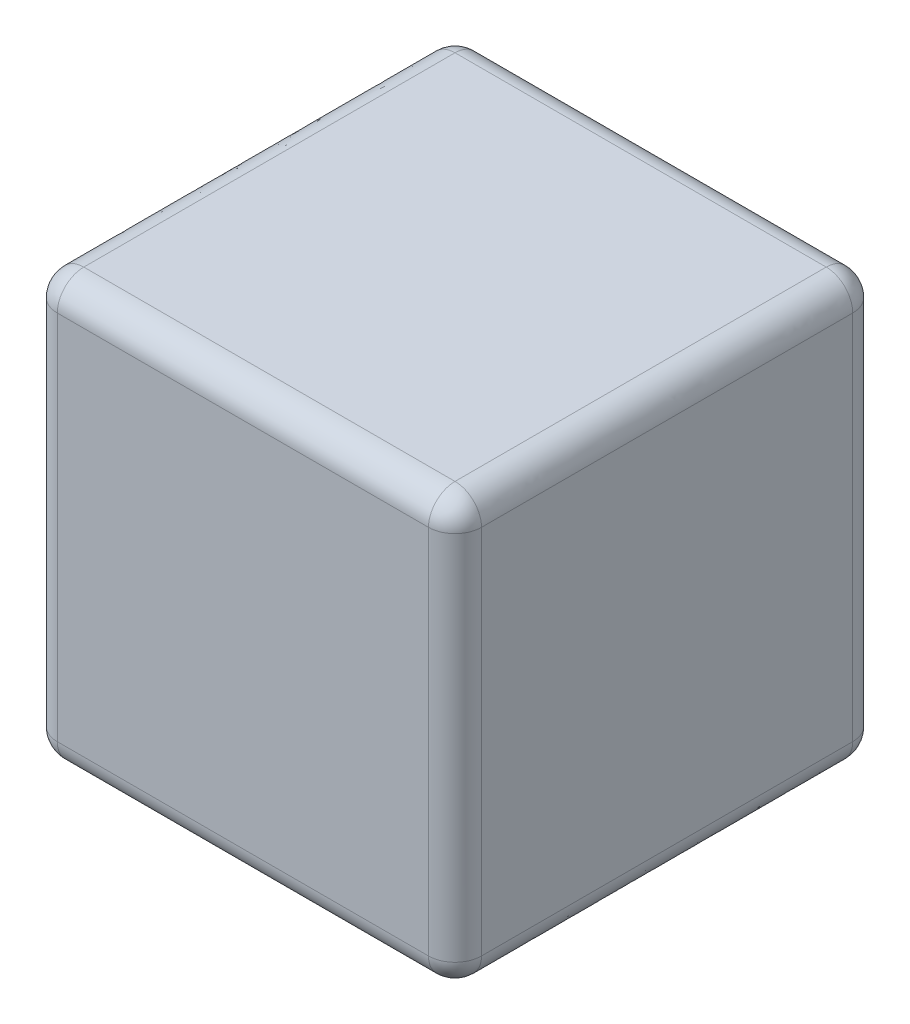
ISO-10303-21;
HEADER;
FILE_DESCRIPTION(('STEP AP214'),'2;1');
FILE_NAME('part.step','',(''),(''),'','','');
FILE_SCHEMA(('AUTOMOTIVE_DESIGN { 1 0 10303 214 1 1 1 1 }'));
ENDSEC;
DATA;
#1=APPLICATION_CONTEXT('core data for automotive mechanical design processes');
#2=APPLICATION_PROTOCOL_DEFINITION('international standard','automotive_design',2000,#1);
#3=PRODUCT_CONTEXT('',#1,'mechanical');
#4=PRODUCT('Part','Part','',(#3));
#5=PRODUCT_RELATED_PRODUCT_CATEGORY('part','',(#4));
#6=PRODUCT_DEFINITION_FORMATION('','',#4);
#7=PRODUCT_DEFINITION_CONTEXT('part definition',#1,'design');
#8=PRODUCT_DEFINITION('design','',#6,#7);
#9=PRODUCT_DEFINITION_SHAPE('','',#8);
#10=(LENGTH_UNIT() NAMED_UNIT(*) SI_UNIT(.MILLI.,.METRE.));
#11=(NAMED_UNIT(*) PLANE_ANGLE_UNIT() SI_UNIT($,.RADIAN.));
#12=(NAMED_UNIT(*) SI_UNIT($,.STERADIAN.) SOLID_ANGLE_UNIT());
#13=UNCERTAINTY_MEASURE_WITH_UNIT(LENGTH_MEASURE(1.E-05),#10,'distance_accuracy_value','');
#14=(GEOMETRIC_REPRESENTATION_CONTEXT(3) GLOBAL_UNCERTAINTY_ASSIGNED_CONTEXT((#13)) GLOBAL_UNIT_ASSIGNED_CONTEXT((#10,
#11,#12)) REPRESENTATION_CONTEXT('',''));
#15=CARTESIAN_POINT('',(0.,0.,0.));
#16=DIRECTION('',(0.,0.,1.));
#17=DIRECTION('',(1.,0.,0.));
#18=AXIS2_PLACEMENT_3D('',#15,#16,#17);
#19=CARTESIAN_POINT('',(-231.4625,122.5056,32.));
#20=CARTESIAN_POINT('',(-232.5641,122.5056,32.));
#21=CARTESIAN_POINT('',(-233.4625,121.6072,32.));
#22=CARTESIAN_POINT('',(-233.4625,120.5056,32.));
#23=B_SPLINE_CURVE_WITH_KNOTS('',3,(#19,#20,#21,#22),.UNSPECIFIED.,.F.,.F.,(4,4),(0.875,1.),.UNSPECIFIED.);
#24=DIRECTION('',(0.,0.,-1.));
#25=VECTOR('',#24,1.);
#26=SURFACE_OF_LINEAR_EXTRUSION('',#23,#25);
#27=DIRECTION('',(0.,0.,-1.));
#28=VECTOR('',#27,1.);
#29=CARTESIAN_POINT('',(-231.4625,122.5056,32.));
#30=LINE('',#29,#28);
#31=CARTESIAN_POINT('',(-231.4625,122.5056,30.));
#32=VERTEX_POINT('',#31);
#33=CARTESIAN_POINT('',(-231.4625,122.5056,2.));
#34=VERTEX_POINT('',#33);
#35=EDGE_CURVE('E277',#32,#34,#30,.T.);
#36=ORIENTED_EDGE('',*,*,#35,.T.);
#37=CARTESIAN_POINT('',(-231.4625,122.5056,2.));
#38=CARTESIAN_POINT('',(-232.5641,122.5056,2.));
#39=CARTESIAN_POINT('',(-233.4625,121.6072,2.));
#40=CARTESIAN_POINT('',(-233.4625,120.5056,2.));
#41=B_SPLINE_CURVE_WITH_KNOTS('',3,(#37,#38,#39,#40),.UNSPECIFIED.,.F.,.F.,(4,4),(0.875,1.),.UNSPECIFIED.);
#42=CARTESIAN_POINT('',(-233.4625,120.5056,2.));
#43=VERTEX_POINT('',#42);
#44=EDGE_CURVE('E616',#34,#43,#41,.T.);
#45=ORIENTED_EDGE('',*,*,#44,.T.);
#46=DIRECTION('',(0.,0.,-1.));
#47=VECTOR('',#46,1.);
#48=CARTESIAN_POINT('',(-233.4625,120.5056,32.));
#49=LINE('',#48,#47);
#50=CARTESIAN_POINT('',(-233.4625,120.5056,30.));
#51=VERTEX_POINT('',#50);
#52=EDGE_CURVE('E152',#51,#43,#49,.T.);
#53=ORIENTED_EDGE('',*,*,#52,.F.);
#54=CARTESIAN_POINT('',(-233.4625,120.5056,30.));
#55=CARTESIAN_POINT('',(-233.4625,121.6072,30.));
#56=CARTESIAN_POINT('',(-232.5641,122.5056,30.));
#57=CARTESIAN_POINT('',(-231.4625,122.5056,30.));
#58=B_SPLINE_CURVE_WITH_KNOTS('',3,(#54,#55,#56,#57),.UNSPECIFIED.,.F.,.F.,(4,4),(0.875,1.),.UNSPECIFIED.);
#59=EDGE_CURVE('E295',#51,#32,#58,.T.);
#60=ORIENTED_EDGE('',*,*,#59,.T.);
#61=EDGE_LOOP('',(#36,#45,#53,#60));
#62=FACE_BOUND('',#61,.T.);
#63=ADVANCED_FACE('F36',(#62),#26,.F.);
#64=CARTESIAN_POINT('',(-233.4625,92.5056,32.));
#65=DIRECTION('',(1.,0.,0.));
#66=DIRECTION('',(0.,0.,-1.));
#67=AXIS2_PLACEMENT_3D('',#64,#65,#66);
#68=PLANE('',#67);
#69=ORIENTED_EDGE('',*,*,#52,.T.);
#70=DIRECTION('',(0.,-1.,0.));
#71=VECTOR('',#70,1.);
#72=CARTESIAN_POINT('',(-233.4625,92.5056,2.));
#73=LINE('',#72,#71);
#74=CARTESIAN_POINT('',(-233.4625,92.5056,2.));
#75=VERTEX_POINT('',#74);
#76=EDGE_CURVE('E151',#43,#75,#73,.T.);
#77=ORIENTED_EDGE('',*,*,#76,.T.);
#78=DIRECTION('',(0.,0.,-1.));
#79=VECTOR('',#78,1.);
#80=CARTESIAN_POINT('',(-233.4625,92.5056,32.));
#81=LINE('',#80,#79);
#82=CARTESIAN_POINT('',(-233.4625,92.5056,30.));
#83=VERTEX_POINT('',#82);
#84=EDGE_CURVE('E131',#83,#75,#81,.T.);
#85=ORIENTED_EDGE('',*,*,#84,.F.);
#86=DIRECTION('',(0.,-1.,0.));
#87=VECTOR('',#86,1.);
#88=CARTESIAN_POINT('',(-233.4625,120.5056,30.));
#89=LINE('',#88,#87);
#90=EDGE_CURVE('E148',#83,#51,#89,.F.);
#91=ORIENTED_EDGE('',*,*,#90,.T.);
#92=EDGE_LOOP('',(#69,#77,#85,#91));
#93=FACE_BOUND('',#92,.T.);
#94=ADVANCED_FACE('F146',(#93),#68,.F.);
#95=CARTESIAN_POINT('',(-233.4625,92.5056,32.));
#96=CARTESIAN_POINT('',(-233.4625,91.404,32.));
#97=CARTESIAN_POINT('',(-232.5641,90.5056,32.));
#98=CARTESIAN_POINT('',(-231.4625,90.5056,32.));
#99=B_SPLINE_CURVE_WITH_KNOTS('',3,(#95,#96,#97,#98),.UNSPECIFIED.,.F.,.F.,(4,4),(0.625,0.75),.UNSPECIFIED.);
#100=DIRECTION('',(0.,0.,-1.));
#101=VECTOR('',#100,1.);
#102=SURFACE_OF_LINEAR_EXTRUSION('',#99,#101);
#103=ORIENTED_EDGE('',*,*,#84,.T.);
#104=CARTESIAN_POINT('',(-233.4625,92.5056,2.));
#105=CARTESIAN_POINT('',(-233.4625,91.404,2.));
#106=CARTESIAN_POINT('',(-232.5641,90.5056,2.));
#107=CARTESIAN_POINT('',(-231.4625,90.5056,2.));
#108=B_SPLINE_CURVE_WITH_KNOTS('',3,(#104,#105,#106,#107),.UNSPECIFIED.,.F.,.F.,(4,4),(0.625,
0.75),.UNSPECIFIED.);
#109=CARTESIAN_POINT('',(-231.4625,90.5056,2.));
#110=VERTEX_POINT('',#109);
#111=EDGE_CURVE('E139',#75,#110,#108,.T.);
#112=ORIENTED_EDGE('',*,*,#111,.T.);
#113=DIRECTION('',(0.,0.,-1.));
#114=VECTOR('',#113,1.);
#115=CARTESIAN_POINT('',(-231.4625,90.5056,32.));
#116=LINE('',#115,#114);
#117=CARTESIAN_POINT('',(-231.4625,90.5056,30.));
#118=VERTEX_POINT('',#117);
#119=EDGE_CURVE('E133',#118,#110,#116,.T.);
#120=ORIENTED_EDGE('',*,*,#119,.F.);
#121=CARTESIAN_POINT('',(-231.4625,90.5056,30.));
#122=CARTESIAN_POINT('',(-232.5641,90.5056,30.));
#123=CARTESIAN_POINT('',(-233.4625,91.404,30.));
#124=CARTESIAN_POINT('',(-233.4625,92.5056,30.));
#125=B_SPLINE_CURVE_WITH_KNOTS('',3,(#121,#122,#123,#124),.UNSPECIFIED.,.F.,.F.,(4,4),(0.625,
0.75),.UNSPECIFIED.);
#126=EDGE_CURVE('E127',#118,#83,#125,.T.);
#127=ORIENTED_EDGE('',*,*,#126,.T.);
#128=EDGE_LOOP('',(#103,#112,#120,#127));
#129=FACE_BOUND('',#128,.T.);
#130=ADVANCED_FACE('F130',(#129),#102,.F.);
#131=CARTESIAN_POINT('',(-203.4625,90.5056,32.));
#132=DIRECTION('',(0.,1.,0.));
#133=DIRECTION('',(0.,0.,1.));
#134=AXIS2_PLACEMENT_3D('',#131,#132,#133);
#135=PLANE('',#134);
#136=ORIENTED_EDGE('',*,*,#119,.T.);
#137=DIRECTION('',(1.,0.,0.));
#138=VECTOR('',#137,1.);
#139=CARTESIAN_POINT('',(-203.4625,90.5056,2.));
#140=LINE('',#139,#138);
#141=CARTESIAN_POINT('',(-203.4625,90.5056,2.));
#142=VERTEX_POINT('',#141);
#143=EDGE_CURVE('E204',#110,#142,#140,.T.);
#144=ORIENTED_EDGE('',*,*,#143,.T.);
#145=DIRECTION('',(0.,0.,-1.));
#146=VECTOR('',#145,1.);
#147=CARTESIAN_POINT('',(-203.4625,90.5056,32.));
#148=LINE('',#147,#146);
#149=CARTESIAN_POINT('',(-203.4625,90.5056,30.));
#150=VERTEX_POINT('',#149);
#151=EDGE_CURVE('E183',#150,#142,#148,.T.);
#152=ORIENTED_EDGE('',*,*,#151,.F.);
#153=DIRECTION('',(1.,0.,0.));
#154=VECTOR('',#153,1.);
#155=CARTESIAN_POINT('',(-231.4625,90.5056,30.));
#156=LINE('',#155,#154);
#157=EDGE_CURVE('E202',#150,#118,#156,.F.);
#158=ORIENTED_EDGE('',*,*,#157,.T.);
#159=EDGE_LOOP('',(#136,#144,#152,#158));
#160=FACE_BOUND('',#159,.T.);
#161=ADVANCED_FACE('F236',(#160),#135,.F.);
#162=CARTESIAN_POINT('',(-203.4625,90.5056,32.));
#163=CARTESIAN_POINT('',(-202.3609,90.5056,32.));
#164=CARTESIAN_POINT('',(-201.4625,91.404,32.));
#165=CARTESIAN_POINT('',(-201.4625,92.5056,32.));
#166=B_SPLINE_CURVE_WITH_KNOTS('',3,(#162,#163,#164,#165),.UNSPECIFIED.,.F.,.F.,(4,4),(0.375,
0.5),.UNSPECIFIED.);
#167=DIRECTION('',(0.,0.,-1.));
#168=VECTOR('',#167,1.);
#169=SURFACE_OF_LINEAR_EXTRUSION('',#166,#168);
#170=ORIENTED_EDGE('',*,*,#151,.T.);
#171=CARTESIAN_POINT('',(-203.4625,90.5056,2.));
#172=CARTESIAN_POINT('',(-202.3609,90.5056,2.));
#173=CARTESIAN_POINT('',(-201.4625,91.404,2.));
#174=CARTESIAN_POINT('',(-201.4625,92.5056,2.));
#175=B_SPLINE_CURVE_WITH_KNOTS('',3,(#171,#172,#173,#174),.UNSPECIFIED.,.F.,.F.,(4,4),(0.375,
0.5),.UNSPECIFIED.);
#176=CARTESIAN_POINT('',(-201.4625,92.5056,2.));
#177=VERTEX_POINT('',#176);
#178=EDGE_CURVE('E793',#142,#177,#175,.T.);
#179=ORIENTED_EDGE('',*,*,#178,.T.);
#180=DIRECTION('',(0.,0.,-1.));
#181=VECTOR('',#180,1.);
#182=CARTESIAN_POINT('',(-201.4625,92.5056,32.));
#183=LINE('',#182,#181);
#184=CARTESIAN_POINT('',(-201.4625,92.5056,30.));
#185=VERTEX_POINT('',#184);
#186=EDGE_CURVE('E197',#185,#177,#183,.T.);
#187=ORIENTED_EDGE('',*,*,#186,.F.);
#188=CARTESIAN_POINT('',(-201.4625,92.5056,30.));
#189=CARTESIAN_POINT('',(-201.4625,91.404,30.));
#190=CARTESIAN_POINT('',(-202.3609,90.5056,30.));
#191=CARTESIAN_POINT('',(-203.4625,90.5056,30.));
#192=B_SPLINE_CURVE_WITH_KNOTS('',3,(#188,#189,#190,#191),.UNSPECIFIED.,.F.,.F.,(4,4),(0.375,
0.5),.UNSPECIFIED.);
#193=EDGE_CURVE('E208',#185,#150,#192,.T.);
#194=ORIENTED_EDGE('',*,*,#193,.T.);
#195=EDGE_LOOP('',(#170,#179,#187,#194));
#196=FACE_BOUND('',#195,.T.);
#197=ADVANCED_FACE('F224',(#196),#169,.F.);
#198=CARTESIAN_POINT('',(-201.4625,120.5056,32.));
#199=DIRECTION('',(-1.,0.,0.));
#200=DIRECTION('',(0.,0.,1.));
#201=AXIS2_PLACEMENT_3D('',#198,#199,#200);
#202=PLANE('',#201);
#203=ORIENTED_EDGE('',*,*,#186,.T.);
#204=DIRECTION('',(0.,1.,0.));
#205=VECTOR('',#204,1.);
#206=CARTESIAN_POINT('',(-201.4625,120.5056,2.));
#207=LINE('',#206,#205);
#208=CARTESIAN_POINT('',(-201.4625,120.5056,2.));
#209=VERTEX_POINT('',#208);
#210=EDGE_CURVE('E750',#177,#209,#207,.T.);
#211=ORIENTED_EDGE('',*,*,#210,.T.);
#212=DIRECTION('',(0.,0.,-1.));
#213=VECTOR('',#212,1.);
#214=CARTESIAN_POINT('',(-201.4625,120.5056,32.));
#215=LINE('',#214,#213);
#216=CARTESIAN_POINT('',(-201.4625,120.5056,30.));
#217=VERTEX_POINT('',#216);
#218=EDGE_CURVE('E213',#217,#209,#215,.T.);
#219=ORIENTED_EDGE('',*,*,#218,.F.);
#220=DIRECTION('',(0.,1.,0.));
#221=VECTOR('',#220,1.);
#222=CARTESIAN_POINT('',(-201.4625,92.5056,30.));
#223=LINE('',#222,#221);
#224=EDGE_CURVE('E611',#217,#185,#223,.F.);
#225=ORIENTED_EDGE('',*,*,#224,.T.);
#226=EDGE_LOOP('',(#203,#211,#219,#225));
#227=FACE_BOUND('',#226,.T.);
#228=ADVANCED_FACE('F235',(#227),#202,.F.);
#229=CARTESIAN_POINT('',(-201.4625,120.5056,32.));
#230=CARTESIAN_POINT('',(-201.4625,121.6072,32.));
#231=CARTESIAN_POINT('',(-202.3609,122.5056,32.));
#232=CARTESIAN_POINT('',(-203.4625,122.5056,32.));
#233=B_SPLINE_CURVE_WITH_KNOTS('',3,(#229,#230,#231,#232),.UNSPECIFIED.,.F.,.F.,(4,4),(0.125,
0.25),.UNSPECIFIED.);
#234=DIRECTION('',(0.,0.,-1.));
#235=VECTOR('',#234,1.);
#236=SURFACE_OF_LINEAR_EXTRUSION('',#233,#235);
#237=ORIENTED_EDGE('',*,*,#218,.T.);
#238=CARTESIAN_POINT('',(-201.4625,120.5056,2.));
#239=CARTESIAN_POINT('',(-201.4625,121.6072,2.));
#240=CARTESIAN_POINT('',(-202.3609,122.5056,2.));
#241=CARTESIAN_POINT('',(-203.4625,122.5056,2.));
#242=B_SPLINE_CURVE_WITH_KNOTS('',3,(#238,#239,#240,#241),.UNSPECIFIED.,.F.,.F.,(4,4),(0.125,
0.25),.UNSPECIFIED.);
#243=CARTESIAN_POINT('',(-203.4625,122.5056,2.));
#244=VERTEX_POINT('',#243);
#245=EDGE_CURVE('E291',#209,#244,#242,.T.);
#246=ORIENTED_EDGE('',*,*,#245,.T.);
#247=DIRECTION('',(0.,0.,-1.));
#248=VECTOR('',#247,1.);
#249=CARTESIAN_POINT('',(-203.4625,122.5056,32.));
#250=LINE('',#249,#248);
#251=CARTESIAN_POINT('',(-203.4625,122.5056,30.));
#252=VERTEX_POINT('',#251);
#253=EDGE_CURVE('E285',#252,#244,#250,.T.);
#254=ORIENTED_EDGE('',*,*,#253,.F.);
#255=CARTESIAN_POINT('',(-203.4625,122.5056,30.));
#256=CARTESIAN_POINT('',(-202.3609,122.5056,30.));
#257=CARTESIAN_POINT('',(-201.4625,121.6072,30.));
#258=CARTESIAN_POINT('',(-201.4625,120.5056,30.));
#259=B_SPLINE_CURVE_WITH_KNOTS('',3,(#255,#256,#257,#258),.UNSPECIFIED.,.F.,.F.,(4,4),(0.125,
0.25),.UNSPECIFIED.);
#260=EDGE_CURVE('E592',#252,#217,#259,.T.);
#261=ORIENTED_EDGE('',*,*,#260,.T.);
#262=EDGE_LOOP('',(#237,#246,#254,#261));
#263=FACE_BOUND('',#262,.T.);
#264=ADVANCED_FACE('F260',(#263),#236,.F.);
#265=CARTESIAN_POINT('',(-231.4625,122.5056,32.));
#266=DIRECTION('',(0.,-1.,0.));
#267=DIRECTION('',(0.,0.,-1.));
#268=AXIS2_PLACEMENT_3D('',#265,#266,#267);
#269=PLANE('',#268);
#270=ORIENTED_EDGE('',*,*,#253,.T.);
#271=DIRECTION('',(-1.,0.,0.));
#272=VECTOR('',#271,1.);
#273=CARTESIAN_POINT('',(-231.4625,122.5056,2.));
#274=LINE('',#273,#272);
#275=EDGE_CURVE('E290',#244,#34,#274,.T.);
#276=ORIENTED_EDGE('',*,*,#275,.T.);
#277=ORIENTED_EDGE('',*,*,#35,.F.);
#278=DIRECTION('',(-1.,0.,0.));
#279=VECTOR('',#278,1.);
#280=CARTESIAN_POINT('',(-203.4625,122.5056,30.));
#281=LINE('',#280,#279);
#282=EDGE_CURVE('E287',#32,#252,#281,.F.);
#283=ORIENTED_EDGE('',*,*,#282,.T.);
#284=EDGE_LOOP('',(#270,#276,#277,#283));
#285=FACE_BOUND('',#284,.T.);
#286=ADVANCED_FACE('F264',(#285),#269,.F.);
#287=CARTESIAN_POINT('',(-232.8756,121.9187,32.));
#288=DIRECTION('',(0.,0.,1.));
#289=DIRECTION('',(1.,0.,0.));
#290=AXIS2_PLACEMENT_3D('',#287,#288,#289);
#291=PLANE('',#290);
#292=DIRECTION('',(0.,1.,0.));
#293=VECTOR('',#292,1.);
#294=CARTESIAN_POINT('',(-203.4625,120.5056,32.));
#295=LINE('',#294,#293);
#296=CARTESIAN_POINT('',(-203.4625,92.5056,32.));
#297=VERTEX_POINT('',#296);
#298=CARTESIAN_POINT('',(-203.4625,120.5056,32.));
#299=VERTEX_POINT('',#298);
#300=EDGE_CURVE('E46',#297,#299,#295,.T.);
#301=ORIENTED_EDGE('',*,*,#300,.T.);
#302=DIRECTION('',(-1.,0.,0.));
#303=VECTOR('',#302,1.);
#304=CARTESIAN_POINT('',(-231.4625,120.5056,32.));
#305=LINE('',#304,#303);
#306=CARTESIAN_POINT('',(-231.4625,120.5056,32.));
#307=VERTEX_POINT('',#306);
#308=EDGE_CURVE('E11',#299,#307,#305,.T.);
#309=ORIENTED_EDGE('',*,*,#308,.T.);
#310=DIRECTION('',(0.,-1.,0.));
#311=VECTOR('',#310,1.);
#312=CARTESIAN_POINT('',(-231.4625,92.5056,32.));
#313=LINE('',#312,#311);
#314=CARTESIAN_POINT('',(-231.4625,92.5056,32.));
#315=VERTEX_POINT('',#314);
#316=EDGE_CURVE('E615',#307,#315,#313,.T.);
#317=ORIENTED_EDGE('',*,*,#316,.T.);
#318=DIRECTION('',(1.,0.,0.));
#319=VECTOR('',#318,1.);
#320=CARTESIAN_POINT('',(-203.4625,92.5056,32.));
#321=LINE('',#320,#319);
#322=EDGE_CURVE('E57',#315,#297,#321,.T.);
#323=ORIENTED_EDGE('',*,*,#322,.T.);
#324=EDGE_LOOP('',(#301,#309,#317,#323));
#325=FACE_BOUND('',#324,.T.);
#326=ADVANCED_FACE('F614',(#325),#291,.T.);
#327=CARTESIAN_POINT('',(-232.8756,121.9187,0.));
#328=DIRECTION('',(0.,0.,1.));
#329=DIRECTION('',(1.,0.,0.));
#330=AXIS2_PLACEMENT_3D('',#327,#328,#329);
#331=PLANE('',#330);
#332=DIRECTION('',(1.,0.,0.));
#333=VECTOR('',#332,1.);
#334=CARTESIAN_POINT('',(-232.8756,92.5056,0.));
#335=LINE('',#334,#333);
#336=CARTESIAN_POINT('',(-203.4625,92.5056,0.));
#337=VERTEX_POINT('',#336);
#338=CARTESIAN_POINT('',(-231.4625,92.5056,0.));
#339=VERTEX_POINT('',#338);
#340=EDGE_CURVE('E488',#337,#339,#335,.F.);
#341=ORIENTED_EDGE('',*,*,#340,.T.);
#342=DIRECTION('',(0.,-1.,0.));
#343=VECTOR('',#342,1.);
#344=CARTESIAN_POINT('',(-231.4625,121.9187,0.));
#345=LINE('',#344,#343);
#346=CARTESIAN_POINT('',(-231.4625,120.5056,0.));
#347=VERTEX_POINT('',#346);
#348=EDGE_CURVE('E140',#339,#347,#345,.F.);
#349=ORIENTED_EDGE('',*,*,#348,.T.);
#350=DIRECTION('',(-1.,0.,0.));
#351=VECTOR('',#350,1.);
#352=CARTESIAN_POINT('',(-232.8756,120.5056,0.));
#353=LINE('',#352,#351);
#354=CARTESIAN_POINT('',(-203.4625,120.5056,0.));
#355=VERTEX_POINT('',#354);
#356=EDGE_CURVE('E174',#347,#355,#353,.F.);
#357=ORIENTED_EDGE('',*,*,#356,.T.);
#358=DIRECTION('',(0.,1.,0.));
#359=VECTOR('',#358,1.);
#360=CARTESIAN_POINT('',(-203.4625,121.9187,0.));
#361=LINE('',#360,#359);
#362=EDGE_CURVE('E492',#355,#337,#361,.F.);
#363=ORIENTED_EDGE('',*,*,#362,.T.);
#364=EDGE_LOOP('',(#341,#349,#357,#363));
#365=FACE_BOUND('',#364,.T.);
#366=ADVANCED_FACE('F469',(#365),#331,.F.);
#367=CARTESIAN_POINT('',(-203.4625,120.5056,2.));
#368=DIRECTION('',(0.,1.,0.));
#369=DIRECTION('',(0.,0.,1.));
#370=AXIS2_PLACEMENT_3D('',#367,#368,#369);
#371=CYLINDRICAL_SURFACE('',#370,2.);
#372=CARTESIAN_POINT('',(-201.4625,120.5056,2.));
#373=CARTESIAN_POINT('',(-201.462499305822,120.5056,1.96727504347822));
#374=CARTESIAN_POINT('',(-201.46330316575,120.5056,1.93455014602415));
#375=CARTESIAN_POINT('',(-201.46651500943,120.5056,1.86917915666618));
#376=CARTESIAN_POINT('',(-201.468922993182,120.5056,1.83653306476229));
#377=CARTESIAN_POINT('',(-201.475338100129,120.5056,1.77139837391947));
#378=CARTESIAN_POINT('',(-201.479345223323,120.5056,1.73890977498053));
#379=CARTESIAN_POINT('',(-201.488948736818,120.5056,1.67416832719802));
#380=CARTESIAN_POINT('',(-201.494545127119,120.5056,1.64191547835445));
#381=CARTESIAN_POINT('',(-201.507313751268,120.5056,1.57772323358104));
#382=CARTESIAN_POINT('',(-201.514485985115,120.5056,1.54578383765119));
#383=CARTESIAN_POINT('',(-201.530389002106,120.5056,1.48229544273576));
#384=CARTESIAN_POINT('',(-201.53911978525,120.5056,1.45074644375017));
#385=CARTESIAN_POINT('',(-201.558118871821,120.5056,1.38811484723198));
#386=CARTESIAN_POINT('',(-201.568387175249,120.5056,1.35703224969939));
#387=CARTESIAN_POINT('',(-201.590436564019,120.5056,1.29540833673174));
#388=CARTESIAN_POINT('',(-201.602217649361,120.5056,1.26486702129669));
#389=CARTESIAN_POINT('',(-201.627264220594,120.5056,1.20439924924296));
#390=CARTESIAN_POINT('',(-201.640529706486,120.5056,1.17447279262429));
#391=CARTESIAN_POINT('',(-201.66851312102,120.5056,1.11530683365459));
#392=CARTESIAN_POINT('',(-201.683231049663,120.5056,1.08606733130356));
#393=CARTESIAN_POINT('',(-201.714083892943,120.5056,1.02834572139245));
#394=CARTESIAN_POINT('',(-201.73021880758,120.5056,0.999863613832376));
#395=CARTESIAN_POINT('',(-201.763866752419,120.5056,0.943725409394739));
#396=CARTESIAN_POINT('',(-201.781379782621,120.5056,0.916069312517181));
#397=CARTESIAN_POINT('',(-201.817741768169,120.5056,0.861649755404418));
#398=CARTESIAN_POINT('',(-201.836590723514,120.5056,0.834886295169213));
#399=CARTESIAN_POINT('',(-201.875579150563,120.5056,0.782316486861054));
#400=CARTESIAN_POINT('',(-201.895718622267,120.5056,0.756510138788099));
#401=CARTESIAN_POINT('',(-201.937239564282,120.5056,0.70591672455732));
#402=CARTESIAN_POINT('',(-201.958621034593,120.5056,0.681129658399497));
#403=CARTESIAN_POINT('',(-202.002574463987,120.5056,0.632634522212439));
#404=CARTESIAN_POINT('',(-202.025146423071,120.5056,0.608926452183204));
#405=CARTESIAN_POINT('',(-202.071426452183,120.5056,0.562646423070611));
#406=CARTESIAN_POINT('',(-202.095134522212,120.5056,0.540074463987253));
#407=CARTESIAN_POINT('',(-202.1436296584,120.5056,0.49612103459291));
#408=CARTESIAN_POINT('',(-202.168416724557,120.5056,0.474739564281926));
#409=CARTESIAN_POINT('',(-202.219010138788,120.5056,0.433218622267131));
#410=CARTESIAN_POINT('',(-202.244816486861,120.5056,0.41307915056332));
#411=CARTESIAN_POINT('',(-202.297386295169,120.5056,0.374090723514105));
#412=CARTESIAN_POINT('',(-202.324149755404,120.5056,0.3552417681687));
#413=CARTESIAN_POINT('',(-202.378569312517,120.5056,0.318879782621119));
#414=CARTESIAN_POINT('',(-202.406225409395,120.5056,0.301366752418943));
#415=CARTESIAN_POINT('',(-202.462363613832,120.5056,0.267718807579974));
#416=CARTESIAN_POINT('',(-202.490845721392,120.5056,0.25158389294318));
#417=CARTESIAN_POINT('',(-202.548567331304,120.5056,0.220731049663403));
#418=CARTESIAN_POINT('',(-202.577806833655,120.5056,0.206013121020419));
#419=CARTESIAN_POINT('',(-202.636972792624,120.5056,0.178029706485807));
#420=CARTESIAN_POINT('',(-202.666899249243,120.5056,0.164764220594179));
#421=CARTESIAN_POINT('',(-202.727367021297,120.5056,0.139717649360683));
#422=CARTESIAN_POINT('',(-202.757908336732,120.5056,0.127936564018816));
#423=CARTESIAN_POINT('',(-202.819532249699,120.5056,0.105887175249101));
#424=CARTESIAN_POINT('',(-202.850614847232,120.5056,0.0956188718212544));
#425=CARTESIAN_POINT('',(-202.91324644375,120.5056,0.0766197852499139));
#426=CARTESIAN_POINT('',(-202.944795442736,120.5056,0.0678890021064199));
#427=CARTESIAN_POINT('',(-203.008283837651,120.5056,0.0519859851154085));
#428=CARTESIAN_POINT('',(-203.040223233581,120.5056,0.0448137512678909));
#429=CARTESIAN_POINT('',(-203.104415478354,120.5056,0.03204512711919));
#430=CARTESIAN_POINT('',(-203.136668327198,120.5056,0.026448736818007));
#431=CARTESIAN_POINT('',(-203.201409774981,120.5056,0.0168452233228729));
#432=CARTESIAN_POINT('',(-203.233898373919,120.5056,0.0128381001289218));
#433=CARTESIAN_POINT('',(-203.299033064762,120.5056,0.00642299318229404));
#434=CARTESIAN_POINT('',(-203.331679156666,120.5056,0.00401500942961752));
#435=CARTESIAN_POINT('',(-203.397050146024,120.5056,0.000803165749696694));
#436=CARTESIAN_POINT('',(-203.429775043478,120.5056,-6.9417754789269E-07));
#437=CARTESIAN_POINT('',(-203.4625,120.5056,0.));
#438=B_SPLINE_CURVE_WITH_KNOTS('',3,(#372,#373,#374,#375,#376,#377,#378,#379,#380,#381,#382,
#383,#384,#385,#386,#387,#388,#389,#390,#391,#392,#393,#394,#395,#396,#397,#398,#399,#400,#401,
#402,#403,#404,#405,#406,#407,#408,#409,#410,#411,#412,#413,#414,#415,#416,#417,#418,#419,#420,
#421,#422,#423,#424,#425,#426,#427,#428,#429,#430,#431,#432,#433,#434,#435,#436,#437),
.UNSPECIFIED.,.F.,.F.,(4,2,2,2,2,2,2,2,2,2,2,2,2,2,2,2,2,2,2,2,2,2,2,2,2,2,2,2,2,2,2,2,4),(0.,
0.0981649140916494,0.196329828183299,0.294494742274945,0.392659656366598,0.490824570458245,
0.588989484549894,0.687154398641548,0.785319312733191,0.883484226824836,0.981649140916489,
1.07981405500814,1.17797896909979,1.27614388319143,1.37430879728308,1.47247371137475,
1.57063862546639,1.66880353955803,1.76696845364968,1.86513336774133,1.96329828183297,
2.06146319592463,2.15962811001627,2.25779302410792,2.35595793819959,2.45412285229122,
2.55228776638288,2.65045268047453,2.74861759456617,2.84678250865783,2.94494742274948,
3.04311233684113,3.14127725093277),.UNSPECIFIED.);
#439=EDGE_CURVE('E286',#209,#355,#438,.T.);
#440=ORIENTED_EDGE('',*,*,#439,.F.);
#441=ORIENTED_EDGE('',*,*,#210,.F.);
#442=CARTESIAN_POINT('',(-203.4625,92.5056,0.));
#443=CARTESIAN_POINT('',(-203.429775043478,92.5056,-6.94177547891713E-07));
#444=CARTESIAN_POINT('',(-203.397050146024,92.5056,0.000803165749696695));
#445=CARTESIAN_POINT('',(-203.331679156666,92.5056,0.00401500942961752));
#446=CARTESIAN_POINT('',(-203.299033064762,92.5056,0.00642299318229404));
#447=CARTESIAN_POINT('',(-203.233898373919,92.5056,0.0128381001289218));
#448=CARTESIAN_POINT('',(-203.201409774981,92.5056,0.0168452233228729));
#449=CARTESIAN_POINT('',(-203.136668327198,92.5056,0.026448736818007));
#450=CARTESIAN_POINT('',(-203.104415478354,92.5056,0.03204512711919));
#451=CARTESIAN_POINT('',(-203.040223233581,92.5056,0.0448137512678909));
#452=CARTESIAN_POINT('',(-203.008283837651,92.5056,0.0519859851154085));
#453=CARTESIAN_POINT('',(-202.944795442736,92.5056,0.0678890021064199));
#454=CARTESIAN_POINT('',(-202.91324644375,92.5056,0.0766197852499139));
#455=CARTESIAN_POINT('',(-202.850614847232,92.5056,0.0956188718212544));
#456=CARTESIAN_POINT('',(-202.819532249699,92.5056,0.105887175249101));
#457=CARTESIAN_POINT('',(-202.757908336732,92.5056,0.127936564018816));
#458=CARTESIAN_POINT('',(-202.727367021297,92.5056,0.139717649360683));
#459=CARTESIAN_POINT('',(-202.666899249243,92.5056,0.164764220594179));
#460=CARTESIAN_POINT('',(-202.636972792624,92.5056,0.178029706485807));
#461=CARTESIAN_POINT('',(-202.577806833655,92.5056,0.206013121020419));
#462=CARTESIAN_POINT('',(-202.548567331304,92.5056,0.220731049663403));
#463=CARTESIAN_POINT('',(-202.490845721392,92.5056,0.25158389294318));
#464=CARTESIAN_POINT('',(-202.462363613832,92.5056,0.267718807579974));
#465=CARTESIAN_POINT('',(-202.406225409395,92.5056,0.301366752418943));
#466=CARTESIAN_POINT('',(-202.378569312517,92.5056,0.318879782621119));
#467=CARTESIAN_POINT('',(-202.324149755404,92.5056,0.3552417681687));
#468=CARTESIAN_POINT('',(-202.297386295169,92.5056,0.374090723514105));
#469=CARTESIAN_POINT('',(-202.244816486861,92.5056,0.41307915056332));
#470=CARTESIAN_POINT('',(-202.219010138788,92.5056,0.433218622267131));
#471=CARTESIAN_POINT('',(-202.168416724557,92.5056,0.474739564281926));
#472=CARTESIAN_POINT('',(-202.1436296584,92.5056,0.49612103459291));
#473=CARTESIAN_POINT('',(-202.095134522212,92.5056,0.540074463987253));
#474=CARTESIAN_POINT('',(-202.071426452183,92.5056,0.562646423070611));
#475=CARTESIAN_POINT('',(-202.025146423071,92.5056,0.608926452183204));
#476=CARTESIAN_POINT('',(-202.002574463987,92.5056,0.632634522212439));
#477=CARTESIAN_POINT('',(-201.958621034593,92.5056,0.681129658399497));
#478=CARTESIAN_POINT('',(-201.937239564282,92.5056,0.70591672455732));
#479=CARTESIAN_POINT('',(-201.895718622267,92.5056,0.756510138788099));
#480=CARTESIAN_POINT('',(-201.875579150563,92.5056,0.782316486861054));
#481=CARTESIAN_POINT('',(-201.836590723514,92.5056,0.834886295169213));
#482=CARTESIAN_POINT('',(-201.817741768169,92.5056,0.861649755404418));
#483=CARTESIAN_POINT('',(-201.781379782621,92.5056,0.916069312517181));
#484=CARTESIAN_POINT('',(-201.763866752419,92.5056,0.943725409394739));
#485=CARTESIAN_POINT('',(-201.73021880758,92.5056,0.999863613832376));
#486=CARTESIAN_POINT('',(-201.714083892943,92.5056,1.02834572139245));
#487=CARTESIAN_POINT('',(-201.683231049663,92.5056,1.08606733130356));
#488=CARTESIAN_POINT('',(-201.66851312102,92.5056,1.11530683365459));
#489=CARTESIAN_POINT('',(-201.640529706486,92.5056,1.17447279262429));
#490=CARTESIAN_POINT('',(-201.627264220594,92.5056,1.20439924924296));
#491=CARTESIAN_POINT('',(-201.602217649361,92.5056,1.26486702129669));
#492=CARTESIAN_POINT('',(-201.590436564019,92.5056,1.29540833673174));
#493=CARTESIAN_POINT('',(-201.568387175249,92.5056,1.35703224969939));
#494=CARTESIAN_POINT('',(-201.558118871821,92.5056,1.38811484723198));
#495=CARTESIAN_POINT('',(-201.53911978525,92.5056,1.45074644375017));
#496=CARTESIAN_POINT('',(-201.530389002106,92.5056,1.48229544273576));
#497=CARTESIAN_POINT('',(-201.514485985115,92.5056,1.54578383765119));
#498=CARTESIAN_POINT('',(-201.507313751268,92.5056,1.57772323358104));
#499=CARTESIAN_POINT('',(-201.494545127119,92.5056,1.64191547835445));
#500=CARTESIAN_POINT('',(-201.488948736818,92.5056,1.67416832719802));
#501=CARTESIAN_POINT('',(-201.479345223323,92.5056,1.73890977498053));
#502=CARTESIAN_POINT('',(-201.475338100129,92.5056,1.77139837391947));
#503=CARTESIAN_POINT('',(-201.468922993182,92.5056,1.83653306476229));
#504=CARTESIAN_POINT('',(-201.46651500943,92.5056,1.86917915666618));
#505=CARTESIAN_POINT('',(-201.46330316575,92.5056,1.93455014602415));
#506=CARTESIAN_POINT('',(-201.462499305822,92.5056,1.96727504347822));
#507=CARTESIAN_POINT('',(-201.4625,92.5056,2.));
#508=B_SPLINE_CURVE_WITH_KNOTS('',3,(#442,#443,#444,#445,#446,#447,#448,#449,#450,#451,#452,
#453,#454,#455,#456,#457,#458,#459,#460,#461,#462,#463,#464,#465,#466,#467,#468,#469,#470,#471,
#472,#473,#474,#475,#476,#477,#478,#479,#480,#481,#482,#483,#484,#485,#486,#487,#488,#489,#490,
#491,#492,#493,#494,#495,#496,#497,#498,#499,#500,#501,#502,#503,#504,#505,#506,#507),
.UNSPECIFIED.,.F.,.F.,(4,2,2,2,2,2,2,2,2,2,2,2,2,2,2,2,2,2,2,2,2,2,2,2,2,2,2,2,2,2,2,2,4),(0.,
0.0981649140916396,0.196329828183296,0.294494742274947,0.392659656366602,0.490824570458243,
0.588989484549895,0.687154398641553,0.785319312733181,0.883484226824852,0.981649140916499,
1.07981405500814,1.1779789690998,1.27614388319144,1.37430879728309,1.47247371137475,
1.57063862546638,1.66880353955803,1.76696845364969,1.86513336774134,1.96329828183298,
2.06146319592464,2.15962811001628,2.25779302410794,2.35595793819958,2.45412285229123,
2.55228776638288,2.65045268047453,2.74861759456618,2.84678250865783,2.94494742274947,
3.04311233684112,3.14127725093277),.UNSPECIFIED.);
#509=EDGE_CURVE('E456',#337,#177,#508,.T.);
#510=ORIENTED_EDGE('',*,*,#509,.F.);
#511=ORIENTED_EDGE('',*,*,#362,.F.);
#512=EDGE_LOOP('',(#440,#441,#510,#511));
#513=FACE_BOUND('',#512,.T.);
#514=ADVANCED_FACE('F460',(#513),#371,.T.);
#515=CARTESIAN_POINT('',(-203.4625,120.5056,2.));
#516=DIRECTION('',(0.,0.,1.));
#517=DIRECTION('',(1.,0.,0.));
#518=AXIS2_PLACEMENT_3D('',#515,#516,#517);
#519=SPHERICAL_SURFACE('',#518,2.);
#520=ORIENTED_EDGE('',*,*,#245,.F.);
#521=ORIENTED_EDGE('',*,*,#439,.T.);
#522=CARTESIAN_POINT('',(-203.4625,120.5056,2.));
#523=DIRECTION('',(-1.,0.,0.));
#524=DIRECTION('',(0.,1.,0.));
#525=AXIS2_PLACEMENT_3D('',#522,#523,#524);
#526=CIRCLE('',#525,2.);
#527=EDGE_CURVE('E718',#244,#355,#526,.T.);
#528=ORIENTED_EDGE('',*,*,#527,.F.);
#529=EDGE_LOOP('',(#520,#521,#528));
#530=FACE_BOUND('',#529,.T.);
#531=ADVANCED_FACE('F434',(#530),#519,.T.);
#532=CARTESIAN_POINT('',(-203.4625,92.5056,2.));
#533=DIRECTION('',(0.,0.,1.));
#534=DIRECTION('',(1.,0.,0.));
#535=AXIS2_PLACEMENT_3D('',#532,#533,#534);
#536=SPHERICAL_SURFACE('',#535,2.);
#537=ORIENTED_EDGE('',*,*,#509,.T.);
#538=ORIENTED_EDGE('',*,*,#178,.F.);
#539=CARTESIAN_POINT('',(-203.4625,92.5056,2.));
#540=DIRECTION('',(-1.,0.,0.));
#541=DIRECTION('',(0.,0.,-1.));
#542=AXIS2_PLACEMENT_3D('',#539,#540,#541);
#543=CIRCLE('',#542,2.);
#544=EDGE_CURVE('E419',#337,#142,#543,.T.);
#545=ORIENTED_EDGE('',*,*,#544,.F.);
#546=EDGE_LOOP('',(#537,#538,#545));
#547=FACE_BOUND('',#546,.T.);
#548=ADVANCED_FACE('F425',(#547),#536,.T.);
#549=CARTESIAN_POINT('',(-231.4625,120.5056,2.));
#550=DIRECTION('',(-1.,0.,0.));
#551=DIRECTION('',(0.,0.,1.));
#552=AXIS2_PLACEMENT_3D('',#549,#550,#551);
#553=CYLINDRICAL_SURFACE('',#552,2.);
#554=ORIENTED_EDGE('',*,*,#527,.T.);
#555=ORIENTED_EDGE('',*,*,#356,.F.);
#556=CARTESIAN_POINT('',(-231.4625,122.5056,2.));
#557=CARTESIAN_POINT('',(-231.4625,122.505600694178,1.96727504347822));
#558=CARTESIAN_POINT('',(-231.4625,122.50479683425,1.93455014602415));
#559=CARTESIAN_POINT('',(-231.4625,122.50158499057,1.86917915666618));
#560=CARTESIAN_POINT('',(-231.4625,122.499177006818,1.83653306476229));
#561=CARTESIAN_POINT('',(-231.4625,122.492761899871,1.77139837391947));
#562=CARTESIAN_POINT('',(-231.4625,122.488754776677,1.73890977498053));
#563=CARTESIAN_POINT('',(-231.4625,122.479151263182,1.67416832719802));
#564=CARTESIAN_POINT('',(-231.4625,122.473554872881,1.64191547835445));
#565=CARTESIAN_POINT('',(-231.4625,122.460786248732,1.57772323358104));
#566=CARTESIAN_POINT('',(-231.4625,122.453614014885,1.54578383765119));
#567=CARTESIAN_POINT('',(-231.4625,122.437710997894,1.48229544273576));
#568=CARTESIAN_POINT('',(-231.4625,122.42898021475,1.45074644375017));
#569=CARTESIAN_POINT('',(-231.4625,122.409981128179,1.38811484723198));
#570=CARTESIAN_POINT('',(-231.4625,122.399712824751,1.35703224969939));
#571=CARTESIAN_POINT('',(-231.4625,122.377663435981,1.29540833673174));
#572=CARTESIAN_POINT('',(-231.4625,122.365882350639,1.26486702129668));
#573=CARTESIAN_POINT('',(-231.4625,122.340835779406,1.20439924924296));
#574=CARTESIAN_POINT('',(-231.4625,122.327570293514,1.17447279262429));
#575=CARTESIAN_POINT('',(-231.4625,122.29958687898,1.11530683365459));
#576=CARTESIAN_POINT('',(-231.4625,122.284868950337,1.08606733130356));
#577=CARTESIAN_POINT('',(-231.4625,122.254016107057,1.02834572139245));
#578=CARTESIAN_POINT('',(-231.4625,122.23788119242,0.999863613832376));
#579=CARTESIAN_POINT('',(-231.4625,122.204233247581,0.943725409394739));
#580=CARTESIAN_POINT('',(-231.4625,122.186720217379,0.91606931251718));
#581=CARTESIAN_POINT('',(-231.4625,122.150358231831,0.861649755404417));
#582=CARTESIAN_POINT('',(-231.4625,122.131509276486,0.834886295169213));
#583=CARTESIAN_POINT('',(-231.4625,122.092520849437,0.782316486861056));
#584=CARTESIAN_POINT('',(-231.4625,122.072381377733,0.756510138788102));
#585=CARTESIAN_POINT('',(-231.4625,122.030860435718,0.705916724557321));
#586=CARTESIAN_POINT('',(-231.4625,122.009478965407,0.681129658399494));
#587=CARTESIAN_POINT('',(-231.4625,121.965525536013,0.632634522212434));
#588=CARTESIAN_POINT('',(-231.4625,121.942953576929,0.608926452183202));
#589=CARTESIAN_POINT('',(-231.4625,121.896673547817,0.562646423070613));
#590=CARTESIAN_POINT('',(-231.4625,121.872965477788,0.540074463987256));
#591=CARTESIAN_POINT('',(-231.4625,121.824470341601,0.496121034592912));
#592=CARTESIAN_POINT('',(-231.4625,121.799683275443,0.474739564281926));
#593=CARTESIAN_POINT('',(-231.4625,121.749089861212,0.433218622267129));
#594=CARTESIAN_POINT('',(-231.4625,121.723283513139,0.413079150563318));
#595=CARTESIAN_POINT('',(-231.4625,121.670713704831,0.374090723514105));
#596=CARTESIAN_POINT('',(-231.4625,121.643950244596,0.355241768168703));
#597=CARTESIAN_POINT('',(-231.4625,121.589530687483,0.318879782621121));
#598=CARTESIAN_POINT('',(-231.4625,121.561874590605,0.301366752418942));
#599=CARTESIAN_POINT('',(-231.4625,121.505736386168,0.267718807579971));
#600=CARTESIAN_POINT('',(-231.4625,121.477254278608,0.25158389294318));
#601=CARTESIAN_POINT('',(-231.4625,121.419532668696,0.220731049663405));
#602=CARTESIAN_POINT('',(-231.4625,121.390293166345,0.206013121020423));
#603=CARTESIAN_POINT('',(-231.4625,121.331127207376,0.178029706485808));
#604=CARTESIAN_POINT('',(-231.4625,121.301200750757,0.164764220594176));
#605=CARTESIAN_POINT('',(-231.4625,121.240732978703,0.13971764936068));
#606=CARTESIAN_POINT('',(-231.4625,121.210191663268,0.127936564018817));
#607=CARTESIAN_POINT('',(-231.4625,121.148567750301,0.105887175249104));
#608=CARTESIAN_POINT('',(-231.4625,121.117485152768,0.0956188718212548));
#609=CARTESIAN_POINT('',(-231.4625,121.05485355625,0.0766197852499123));
#610=CARTESIAN_POINT('',(-231.4625,121.023304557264,0.0678890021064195));
#611=CARTESIAN_POINT('',(-231.4625,120.959816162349,0.0519859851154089));
#612=CARTESIAN_POINT('',(-231.4625,120.927876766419,0.044813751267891));
#613=CARTESIAN_POINT('',(-231.4625,120.863684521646,0.0320451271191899));
#614=CARTESIAN_POINT('',(-231.4625,120.831431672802,0.026448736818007));
#615=CARTESIAN_POINT('',(-231.4625,120.766690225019,0.016845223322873));
#616=CARTESIAN_POINT('',(-231.4625,120.734201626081,0.0128381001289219));
#617=CARTESIAN_POINT('',(-231.4625,120.669066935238,0.00642299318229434));
#618=CARTESIAN_POINT('',(-231.4625,120.636420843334,0.00401500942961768));
#619=CARTESIAN_POINT('',(-231.4625,120.571049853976,0.000803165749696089));
#620=CARTESIAN_POINT('',(-231.4625,120.538324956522,-6.94177548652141E-07));
#621=CARTESIAN_POINT('',(-231.4625,120.5056,0.));
#622=B_SPLINE_CURVE_WITH_KNOTS('',3,(#556,#557,#558,#559,#560,#561,#562,#563,#564,#565,#566,
#567,#568,#569,#570,#571,#572,#573,#574,#575,#576,#577,#578,#579,#580,#581,#582,#583,#584,#585,
#586,#587,#588,#589,#590,#591,#592,#593,#594,#595,#596,#597,#598,#599,#600,#601,#602,#603,#604,
#605,#606,#607,#608,#609,#610,#611,#612,#613,#614,#615,#616,#617,#618,#619,#620,#621),
.UNSPECIFIED.,.F.,.F.,(4,2,2,2,2,2,2,2,2,2,2,2,2,2,2,2,2,2,2,2,2,2,2,2,2,2,2,2,2,2,2,2,4),(0.,
0.098164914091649,0.196329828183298,0.294494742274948,0.392659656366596,0.490824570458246,
0.588989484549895,0.687154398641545,0.785319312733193,0.883484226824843,0.981649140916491,
1.07981405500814,1.17797896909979,1.27614388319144,1.37430879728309,1.47247371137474,
1.57063862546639,1.66880353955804,1.76696845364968,1.86513336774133,1.96329828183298,
2.06146319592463,2.15962811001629,2.25779302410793,2.35595793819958,2.45412285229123,
2.55228776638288,2.65045268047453,2.74861759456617,2.84678250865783,2.94494742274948,
3.04311233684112,3.14127725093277),.UNSPECIFIED.);
#623=EDGE_CURVE('E712',#34,#347,#622,.T.);
#624=ORIENTED_EDGE('',*,*,#623,.F.);
#625=ORIENTED_EDGE('',*,*,#275,.F.);
#626=EDGE_LOOP('',(#554,#555,#624,#625));
#627=FACE_BOUND('',#626,.T.);
#628=ADVANCED_FACE('F398',(#627),#553,.T.);
#629=CARTESIAN_POINT('',(-203.4625,92.5056,2.));
#630=DIRECTION('',(1.,0.,0.));
#631=DIRECTION('',(0.,0.,-1.));
#632=AXIS2_PLACEMENT_3D('',#629,#630,#631);
#633=CYLINDRICAL_SURFACE('',#632,2.);
#634=ORIENTED_EDGE('',*,*,#544,.T.);
#635=ORIENTED_EDGE('',*,*,#143,.F.);
#636=CARTESIAN_POINT('',(-231.4625,92.5056,0.));
#637=CARTESIAN_POINT('',(-231.4625,92.4728750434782,-6.94177548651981E-07));
#638=CARTESIAN_POINT('',(-231.4625,92.4401501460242,0.000803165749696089));
#639=CARTESIAN_POINT('',(-231.4625,92.3747791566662,0.00401500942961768));
#640=CARTESIAN_POINT('',(-231.4625,92.3421330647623,0.00642299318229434));
#641=CARTESIAN_POINT('',(-231.4625,92.2769983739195,0.0128381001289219));
#642=CARTESIAN_POINT('',(-231.4625,92.2445097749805,0.016845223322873));
#643=CARTESIAN_POINT('',(-231.4625,92.179768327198,0.026448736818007));
#644=CARTESIAN_POINT('',(-231.4625,92.1475154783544,0.0320451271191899));
#645=CARTESIAN_POINT('',(-231.4625,92.083323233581,0.044813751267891));
#646=CARTESIAN_POINT('',(-231.4625,92.0513838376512,0.0519859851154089));
#647=CARTESIAN_POINT('',(-231.4625,91.9878954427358,0.0678890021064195));
#648=CARTESIAN_POINT('',(-231.4625,91.9563464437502,0.0766197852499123));
#649=CARTESIAN_POINT('',(-231.4625,91.893714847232,0.0956188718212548));
#650=CARTESIAN_POINT('',(-231.4625,91.8626322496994,0.105887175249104));
#651=CARTESIAN_POINT('',(-231.4625,91.8010083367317,0.127936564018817));
#652=CARTESIAN_POINT('',(-231.4625,91.7704670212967,0.13971764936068));
#653=CARTESIAN_POINT('',(-231.4625,91.709999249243,0.164764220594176));
#654=CARTESIAN_POINT('',(-231.4625,91.6800727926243,0.178029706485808));
#655=CARTESIAN_POINT('',(-231.4625,91.6209068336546,0.206013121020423));
#656=CARTESIAN_POINT('',(-231.4625,91.5916673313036,0.220731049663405));
#657=CARTESIAN_POINT('',(-231.4625,91.5339457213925,0.25158389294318));
#658=CARTESIAN_POINT('',(-231.4625,91.5054636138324,0.267718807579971));
#659=CARTESIAN_POINT('',(-231.4625,91.4493254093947,0.301366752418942));
#660=CARTESIAN_POINT('',(-231.4625,91.4216693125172,0.318879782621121));
#661=CARTESIAN_POINT('',(-231.4625,91.3672497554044,0.355241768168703));
#662=CARTESIAN_POINT('',(-231.4625,91.3404862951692,0.374090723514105));
#663=CARTESIAN_POINT('',(-231.4625,91.2879164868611,0.413079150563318));
#664=CARTESIAN_POINT('',(-231.4625,91.2621101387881,0.433218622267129));
#665=CARTESIAN_POINT('',(-231.4625,91.2115167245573,0.474739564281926));
#666=CARTESIAN_POINT('',(-231.4625,91.1867296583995,0.496121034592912));
#667=CARTESIAN_POINT('',(-231.4625,91.1382345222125,0.540074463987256));
#668=CARTESIAN_POINT('',(-231.4625,91.1145264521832,0.562646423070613));
#669=CARTESIAN_POINT('',(-231.4625,91.0682464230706,0.608926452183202));
#670=CARTESIAN_POINT('',(-231.4625,91.0456744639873,0.632634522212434));
#671=CARTESIAN_POINT('',(-231.4625,91.0017210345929,0.681129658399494));
#672=CARTESIAN_POINT('',(-231.4625,90.9803395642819,0.705916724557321));
#673=CARTESIAN_POINT('',(-231.4625,90.9388186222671,0.756510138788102));
#674=CARTESIAN_POINT('',(-231.4625,90.9186791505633,0.782316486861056));
#675=CARTESIAN_POINT('',(-231.4625,90.8796907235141,0.834886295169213));
#676=CARTESIAN_POINT('',(-231.4625,90.8608417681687,0.861649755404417));
#677=CARTESIAN_POINT('',(-231.4625,90.8244797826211,0.91606931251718));
#678=CARTESIAN_POINT('',(-231.4625,90.8069667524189,0.943725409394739));
#679=CARTESIAN_POINT('',(-231.4625,90.77331880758,0.999863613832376));
#680=CARTESIAN_POINT('',(-231.4625,90.7571838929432,1.02834572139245));
#681=CARTESIAN_POINT('',(-231.4625,90.7263310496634,1.08606733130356));
#682=CARTESIAN_POINT('',(-231.4625,90.7116131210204,1.11530683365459));
#683=CARTESIAN_POINT('',(-231.4625,90.6836297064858,1.17447279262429));
#684=CARTESIAN_POINT('',(-231.4625,90.6703642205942,1.20439924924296));
#685=CARTESIAN_POINT('',(-231.4625,90.6453176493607,1.26486702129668));
#686=CARTESIAN_POINT('',(-231.4625,90.6335365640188,1.29540833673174));
#687=CARTESIAN_POINT('',(-231.4625,90.6114871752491,1.35703224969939));
#688=CARTESIAN_POINT('',(-231.4625,90.6012188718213,1.38811484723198));
#689=CARTESIAN_POINT('',(-231.4625,90.5822197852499,1.45074644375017));
#690=CARTESIAN_POINT('',(-231.4625,90.5734890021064,1.48229544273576));
#691=CARTESIAN_POINT('',(-231.4625,90.5575859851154,1.54578383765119));
#692=CARTESIAN_POINT('',(-231.4625,90.5504137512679,1.57772323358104));
#693=CARTESIAN_POINT('',(-231.4625,90.5376451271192,1.64191547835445));
#694=CARTESIAN_POINT('',(-231.4625,90.532048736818,1.67416832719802));
#695=CARTESIAN_POINT('',(-231.4625,90.5224452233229,1.73890977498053));
#696=CARTESIAN_POINT('',(-231.4625,90.5184381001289,1.77139837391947));
#697=CARTESIAN_POINT('',(-231.4625,90.5120229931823,1.83653306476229));
#698=CARTESIAN_POINT('',(-231.4625,90.5096150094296,1.86917915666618));
#699=CARTESIAN_POINT('',(-231.4625,90.5064031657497,1.93455014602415));
#700=CARTESIAN_POINT('',(-231.4625,90.5055993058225,1.96727504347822));
#701=CARTESIAN_POINT('',(-231.4625,90.5056,2.));
#702=B_SPLINE_CURVE_WITH_KNOTS('',3,(#636,#637,#638,#639,#640,#641,#642,#643,#644,#645,#646,
#647,#648,#649,#650,#651,#652,#653,#654,#655,#656,#657,#658,#659,#660,#661,#662,#663,#664,#665,
#666,#667,#668,#669,#670,#671,#672,#673,#674,#675,#676,#677,#678,#679,#680,#681,#682,#683,#684,
#685,#686,#687,#688,#689,#690,#691,#692,#693,#694,#695,#696,#697,#698,#699,#700,#701),
.UNSPECIFIED.,.F.,.F.,(4,2,2,2,2,2,2,2,2,2,2,2,2,2,2,2,2,2,2,2,2,2,2,2,2,2,2,2,2,2,2,2,4),(0.,
0.0981649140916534,0.196329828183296,0.294494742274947,0.392659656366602,0.490824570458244,
0.588989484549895,0.68715439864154,0.785319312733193,0.883484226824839,0.981649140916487,
1.07981405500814,1.17797896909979,1.27614388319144,1.37430879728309,1.47247371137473,
1.57063862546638,1.66880353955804,1.76696845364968,1.86513336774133,1.96329828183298,
2.06146319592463,2.15962811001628,2.25779302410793,2.35595793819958,2.45412285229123,
2.55228776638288,2.65045268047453,2.74861759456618,2.84678250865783,2.94494742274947,
3.04311233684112,3.14127725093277),.UNSPECIFIED.);
#703=EDGE_CURVE('E385',#339,#110,#702,.T.);
#704=ORIENTED_EDGE('',*,*,#703,.F.);
#705=ORIENTED_EDGE('',*,*,#340,.F.);
#706=EDGE_LOOP('',(#634,#635,#704,#705));
#707=FACE_BOUND('',#706,.T.);
#708=ADVANCED_FACE('F389',(#707),#633,.T.);
#709=CARTESIAN_POINT('',(-231.4625,120.5056,2.));
#710=DIRECTION('',(0.,0.,1.));
#711=DIRECTION('',(1.,0.,0.));
#712=AXIS2_PLACEMENT_3D('',#709,#710,#711);
#713=SPHERICAL_SURFACE('',#712,2.);
#714=ORIENTED_EDGE('',*,*,#44,.F.);
#715=ORIENTED_EDGE('',*,*,#623,.T.);
#716=CARTESIAN_POINT('',(-231.4625,120.5056,2.));
#717=DIRECTION('',(0.,-1.,0.));
#718=DIRECTION('',(-1.,0.,0.));
#719=AXIS2_PLACEMENT_3D('',#716,#717,#718);
#720=CIRCLE('',#719,2.);
#721=EDGE_CURVE('E693',#43,#347,#720,.T.);
#722=ORIENTED_EDGE('',*,*,#721,.F.);
#723=EDGE_LOOP('',(#714,#715,#722));
#724=FACE_BOUND('',#723,.T.);
#725=ADVANCED_FACE('F363',(#724),#713,.T.);
#726=CARTESIAN_POINT('',(-231.4625,92.5056,2.));
#727=DIRECTION('',(0.,0.,1.));
#728=DIRECTION('',(1.,0.,0.));
#729=AXIS2_PLACEMENT_3D('',#726,#727,#728);
#730=SPHERICAL_SURFACE('',#729,2.);
#731=ORIENTED_EDGE('',*,*,#703,.T.);
#732=ORIENTED_EDGE('',*,*,#111,.F.);
#733=CARTESIAN_POINT('',(-231.4625,92.5056,2.));
#734=DIRECTION('',(0.,1.,0.));
#735=DIRECTION('',(0.,0.,-1.));
#736=AXIS2_PLACEMENT_3D('',#733,#734,#735);
#737=CIRCLE('',#736,2.);
#738=EDGE_CURVE('E337',#339,#75,#737,.T.);
#739=ORIENTED_EDGE('',*,*,#738,.F.);
#740=EDGE_LOOP('',(#731,#732,#739));
#741=FACE_BOUND('',#740,.T.);
#742=ADVANCED_FACE('F354',(#741),#730,.T.);
#743=CARTESIAN_POINT('',(-231.4625,92.5056,2.));
#744=DIRECTION('',(0.,-1.,0.));
#745=DIRECTION('',(0.,0.,-1.));
#746=AXIS2_PLACEMENT_3D('',#743,#744,#745);
#747=CYLINDRICAL_SURFACE('',#746,2.);
#748=ORIENTED_EDGE('',*,*,#721,.T.);
#749=ORIENTED_EDGE('',*,*,#348,.F.);
#750=ORIENTED_EDGE('',*,*,#738,.T.);
#751=ORIENTED_EDGE('',*,*,#76,.F.);
#752=EDGE_LOOP('',(#748,#749,#750,#751));
#753=FACE_BOUND('',#752,.T.);
#754=ADVANCED_FACE('F315',(#753),#747,.T.);
#755=CARTESIAN_POINT('',(-232.8756,92.5056,30.));
#756=DIRECTION('',(-1.,0.,0.));
#757=DIRECTION('',(0.,0.,1.));
#758=AXIS2_PLACEMENT_3D('',#755,#756,#757);
#759=CYLINDRICAL_SURFACE('',#758,2.);
#760=CARTESIAN_POINT('',(-231.4625,90.5056,30.));
#761=CARTESIAN_POINT('',(-231.4625,90.5055993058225,30.0327249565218));
#762=CARTESIAN_POINT('',(-231.4625,90.5064031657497,30.0654498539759));
#763=CARTESIAN_POINT('',(-231.4625,90.5096150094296,30.1308208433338));
#764=CARTESIAN_POINT('',(-231.4625,90.5120229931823,30.1634669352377));
#765=CARTESIAN_POINT('',(-231.4625,90.5184381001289,30.2286016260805));
#766=CARTESIAN_POINT('',(-231.4625,90.5224452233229,30.2610902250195));
#767=CARTESIAN_POINT('',(-231.4625,90.532048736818,30.325831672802));
#768=CARTESIAN_POINT('',(-231.4625,90.5376451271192,30.3580845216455));
#769=CARTESIAN_POINT('',(-231.4625,90.5504137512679,30.422276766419));
#770=CARTESIAN_POINT('',(-231.4625,90.5575859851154,30.4542161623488));
#771=CARTESIAN_POINT('',(-231.4625,90.5734890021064,30.5177045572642));
#772=CARTESIAN_POINT('',(-231.4625,90.5822197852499,30.5492535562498));
#773=CARTESIAN_POINT('',(-231.4625,90.6012188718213,30.611885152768));
#774=CARTESIAN_POINT('',(-231.4625,90.6114871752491,30.6429677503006));
#775=CARTESIAN_POINT('',(-231.4625,90.6335365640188,30.7045916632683));
#776=CARTESIAN_POINT('',(-231.4625,90.6453176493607,30.7351329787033));
#777=CARTESIAN_POINT('',(-231.4625,90.6703642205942,30.795600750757));
#778=CARTESIAN_POINT('',(-231.4625,90.6836297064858,30.8255272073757));
#779=CARTESIAN_POINT('',(-231.4625,90.7116131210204,30.8846931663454));
#780=CARTESIAN_POINT('',(-231.4625,90.7263310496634,30.9139326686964));
#781=CARTESIAN_POINT('',(-231.4625,90.7571838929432,30.9716542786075));
#782=CARTESIAN_POINT('',(-231.4625,90.77331880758,31.0001363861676));
#783=CARTESIAN_POINT('',(-231.4625,90.8069667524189,31.0562745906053));
#784=CARTESIAN_POINT('',(-231.4625,90.8244797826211,31.0839306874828));
#785=CARTESIAN_POINT('',(-231.4625,90.8608417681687,31.1383502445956));
#786=CARTESIAN_POINT('',(-231.4625,90.8796907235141,31.1651137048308));
#787=CARTESIAN_POINT('',(-231.4625,90.9186791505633,31.2176835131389));
#788=CARTESIAN_POINT('',(-231.4625,90.9388186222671,31.2434898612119));
#789=CARTESIAN_POINT('',(-231.4625,90.9803395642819,31.2940832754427));
#790=CARTESIAN_POINT('',(-231.4625,91.0017210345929,31.3188703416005));
#791=CARTESIAN_POINT('',(-231.4625,91.0456744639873,31.3673654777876));
#792=CARTESIAN_POINT('',(-231.4625,91.0682464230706,31.3910735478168));
#793=CARTESIAN_POINT('',(-231.4625,91.1145264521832,31.4373535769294));
#794=CARTESIAN_POINT('',(-231.4625,91.1382345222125,31.4599255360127));
#795=CARTESIAN_POINT('',(-231.4625,91.1867296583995,31.5038789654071));
#796=CARTESIAN_POINT('',(-231.4625,91.2115167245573,31.5252604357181));
#797=CARTESIAN_POINT('',(-231.4625,91.2621101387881,31.5667813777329));
#798=CARTESIAN_POINT('',(-231.4625,91.2879164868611,31.5869208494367));
#799=CARTESIAN_POINT('',(-231.4625,91.3404862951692,31.6259092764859));
#800=CARTESIAN_POINT('',(-231.4625,91.3672497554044,31.6447582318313));
#801=CARTESIAN_POINT('',(-231.4625,91.4216693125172,31.6811202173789));
#802=CARTESIAN_POINT('',(-231.4625,91.4493254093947,31.6986332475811));
#803=CARTESIAN_POINT('',(-231.4625,91.5054636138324,31.73228119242));
#804=CARTESIAN_POINT('',(-231.4625,91.5339457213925,31.7484161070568));
#805=CARTESIAN_POINT('',(-231.4625,91.5916673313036,31.7792689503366));
#806=CARTESIAN_POINT('',(-231.4625,91.6209068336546,31.7939868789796));
#807=CARTESIAN_POINT('',(-231.4625,91.6800727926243,31.8219702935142));
#808=CARTESIAN_POINT('',(-231.4625,91.709999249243,31.8352357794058));
#809=CARTESIAN_POINT('',(-231.4625,91.7704670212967,31.8602823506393));
#810=CARTESIAN_POINT('',(-231.4625,91.8010083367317,31.8720634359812));
#811=CARTESIAN_POINT('',(-231.4625,91.8626322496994,31.8941128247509));
#812=CARTESIAN_POINT('',(-231.4625,91.893714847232,31.9043811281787));
#813=CARTESIAN_POINT('',(-231.4625,91.9563464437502,31.9233802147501));
#814=CARTESIAN_POINT('',(-231.4625,91.9878954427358,31.9321109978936));
#815=CARTESIAN_POINT('',(-231.4625,92.0513838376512,31.9480140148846));
#816=CARTESIAN_POINT('',(-231.4625,92.083323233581,31.9551862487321));
#817=CARTESIAN_POINT('',(-231.4625,92.1475154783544,31.9679548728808));
#818=CARTESIAN_POINT('',(-231.4625,92.179768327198,31.973551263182));
#819=CARTESIAN_POINT('',(-231.4625,92.2445097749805,31.9831547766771));
#820=CARTESIAN_POINT('',(-231.4625,92.2769983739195,31.9871618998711));
#821=CARTESIAN_POINT('',(-231.4625,92.3421330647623,31.9935770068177));
#822=CARTESIAN_POINT('',(-231.4625,92.3747791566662,31.9959849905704));
#823=CARTESIAN_POINT('',(-231.4625,92.4401501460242,31.9991968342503));
#824=CARTESIAN_POINT('',(-231.4625,92.4728750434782,32.0000006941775));
#825=CARTESIAN_POINT('',(-231.4625,92.5056,32.));
#826=B_SPLINE_CURVE_WITH_KNOTS('',3,(#760,#761,#762,#763,#764,#765,#766,#767,#768,#769,#770,
#771,#772,#773,#774,#775,#776,#777,#778,#779,#780,#781,#782,#783,#784,#785,#786,#787,#788,#789,
#790,#791,#792,#793,#794,#795,#796,#797,#798,#799,#800,#801,#802,#803,#804,#805,#806,#807,#808,
#809,#810,#811,#812,#813,#814,#815,#816,#817,#818,#819,#820,#821,#822,#823,#824,#825),
.UNSPECIFIED.,.F.,.F.,(4,2,2,2,2,2,2,2,2,2,2,2,2,2,2,2,2,2,2,2,2,2,2,2,2,2,2,2,2,2,2,2,4),(0.,
0.0981649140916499,0.196329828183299,0.294494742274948,0.392659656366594,0.490824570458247,
0.588989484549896,0.687154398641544,0.785319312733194,0.883484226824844,0.981649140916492,
1.07981405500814,1.17797896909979,1.27614388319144,1.37430879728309,1.47247371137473,
1.57063862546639,1.66880353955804,1.76696845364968,1.86513336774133,1.96329828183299,
2.06146319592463,2.15962811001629,2.25779302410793,2.35595793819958,2.45412285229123,
2.55228776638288,2.65045268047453,2.74861759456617,2.84678250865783,2.94494742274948,
3.04311233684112,3.14127725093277),.UNSPECIFIED.);
#827=EDGE_CURVE('E158',#118,#315,#826,.T.);
#828=ORIENTED_EDGE('',*,*,#827,.F.);
#829=ORIENTED_EDGE('',*,*,#157,.F.);
#830=CARTESIAN_POINT('',(-203.4625,92.5056,32.));
#831=CARTESIAN_POINT('',(-203.4625,92.4728750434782,32.0000006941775));
#832=CARTESIAN_POINT('',(-203.4625,92.4401501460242,31.9991968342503));
#833=CARTESIAN_POINT('',(-203.4625,92.3747791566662,31.9959849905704));
#834=CARTESIAN_POINT('',(-203.4625,92.3421330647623,31.9935770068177));
#835=CARTESIAN_POINT('',(-203.4625,92.2769983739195,31.9871618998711));
#836=CARTESIAN_POINT('',(-203.4625,92.2445097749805,31.9831547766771));
#837=CARTESIAN_POINT('',(-203.4625,92.179768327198,31.973551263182));
#838=CARTESIAN_POINT('',(-203.4625,92.1475154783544,31.9679548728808));
#839=CARTESIAN_POINT('',(-203.4625,92.083323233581,31.9551862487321));
#840=CARTESIAN_POINT('',(-203.4625,92.0513838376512,31.9480140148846));
#841=CARTESIAN_POINT('',(-203.4625,91.9878954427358,31.9321109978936));
#842=CARTESIAN_POINT('',(-203.4625,91.9563464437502,31.9233802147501));
#843=CARTESIAN_POINT('',(-203.4625,91.893714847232,31.9043811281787));
#844=CARTESIAN_POINT('',(-203.4625,91.8626322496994,31.8941128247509));
#845=CARTESIAN_POINT('',(-203.4625,91.8010083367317,31.8720634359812));
#846=CARTESIAN_POINT('',(-203.4625,91.7704670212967,31.8602823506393));
#847=CARTESIAN_POINT('',(-203.4625,91.709999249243,31.8352357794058));
#848=CARTESIAN_POINT('',(-203.4625,91.6800727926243,31.8219702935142));
#849=CARTESIAN_POINT('',(-203.4625,91.6209068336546,31.7939868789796));
#850=CARTESIAN_POINT('',(-203.4625,91.5916673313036,31.7792689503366));
#851=CARTESIAN_POINT('',(-203.4625,91.5339457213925,31.7484161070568));
#852=CARTESIAN_POINT('',(-203.4625,91.5054636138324,31.73228119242));
#853=CARTESIAN_POINT('',(-203.4625,91.4493254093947,31.6986332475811));
#854=CARTESIAN_POINT('',(-203.4625,91.4216693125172,31.6811202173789));
#855=CARTESIAN_POINT('',(-203.4625,91.3672497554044,31.6447582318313));
#856=CARTESIAN_POINT('',(-203.4625,91.3404862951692,31.6259092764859));
#857=CARTESIAN_POINT('',(-203.4625,91.2879164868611,31.5869208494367));
#858=CARTESIAN_POINT('',(-203.4625,91.2621101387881,31.5667813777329));
#859=CARTESIAN_POINT('',(-203.4625,91.2115167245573,31.5252604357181));
#860=CARTESIAN_POINT('',(-203.4625,91.1867296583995,31.5038789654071));
#861=CARTESIAN_POINT('',(-203.4625,91.1382345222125,31.4599255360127));
#862=CARTESIAN_POINT('',(-203.4625,91.1145264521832,31.4373535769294));
#863=CARTESIAN_POINT('',(-203.4625,91.0682464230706,31.3910735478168));
#864=CARTESIAN_POINT('',(-203.4625,91.0456744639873,31.3673654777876));
#865=CARTESIAN_POINT('',(-203.4625,91.0017210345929,31.3188703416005));
#866=CARTESIAN_POINT('',(-203.4625,90.9803395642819,31.2940832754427));
#867=CARTESIAN_POINT('',(-203.4625,90.9388186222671,31.2434898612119));
#868=CARTESIAN_POINT('',(-203.4625,90.9186791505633,31.2176835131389));
#869=CARTESIAN_POINT('',(-203.4625,90.8796907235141,31.1651137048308));
#870=CARTESIAN_POINT('',(-203.4625,90.8608417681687,31.1383502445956));
#871=CARTESIAN_POINT('',(-203.4625,90.8244797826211,31.0839306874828));
#872=CARTESIAN_POINT('',(-203.4625,90.8069667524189,31.0562745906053));
#873=CARTESIAN_POINT('',(-203.4625,90.77331880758,31.0001363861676));
#874=CARTESIAN_POINT('',(-203.4625,90.7571838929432,30.9716542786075));
#875=CARTESIAN_POINT('',(-203.4625,90.7263310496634,30.9139326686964));
#876=CARTESIAN_POINT('',(-203.4625,90.7116131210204,30.8846931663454));
#877=CARTESIAN_POINT('',(-203.4625,90.6836297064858,30.8255272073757));
#878=CARTESIAN_POINT('',(-203.4625,90.6703642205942,30.795600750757));
#879=CARTESIAN_POINT('',(-203.4625,90.6453176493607,30.7351329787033));
#880=CARTESIAN_POINT('',(-203.4625,90.6335365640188,30.7045916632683));
#881=CARTESIAN_POINT('',(-203.4625,90.6114871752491,30.6429677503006));
#882=CARTESIAN_POINT('',(-203.4625,90.6012188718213,30.611885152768));
#883=CARTESIAN_POINT('',(-203.4625,90.5822197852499,30.5492535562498));
#884=CARTESIAN_POINT('',(-203.4625,90.5734890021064,30.5177045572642));
#885=CARTESIAN_POINT('',(-203.4625,90.5575859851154,30.4542161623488));
#886=CARTESIAN_POINT('',(-203.4625,90.5504137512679,30.422276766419));
#887=CARTESIAN_POINT('',(-203.4625,90.5376451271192,30.3580845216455));
#888=CARTESIAN_POINT('',(-203.4625,90.532048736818,30.325831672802));
#889=CARTESIAN_POINT('',(-203.4625,90.5224452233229,30.2610902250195));
#890=CARTESIAN_POINT('',(-203.4625,90.5184381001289,30.2286016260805));
#891=CARTESIAN_POINT('',(-203.4625,90.5120229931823,30.1634669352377));
#892=CARTESIAN_POINT('',(-203.4625,90.5096150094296,30.1308208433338));
#893=CARTESIAN_POINT('',(-203.4625,90.5064031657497,30.0654498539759));
#894=CARTESIAN_POINT('',(-203.4625,90.5055993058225,30.0327249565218));
#895=CARTESIAN_POINT('',(-203.4625,90.5056,30.));
#896=B_SPLINE_CURVE_WITH_KNOTS('',3,(#830,#831,#832,#833,#834,#835,#836,#837,#838,#839,#840,
#841,#842,#843,#844,#845,#846,#847,#848,#849,#850,#851,#852,#853,#854,#855,#856,#857,#858,#859,
#860,#861,#862,#863,#864,#865,#866,#867,#868,#869,#870,#871,#872,#873,#874,#875,#876,#877,#878,
#879,#880,#881,#882,#883,#884,#885,#886,#887,#888,#889,#890,#891,#892,#893,#894,#895),
.UNSPECIFIED.,.F.,.F.,(4,2,2,2,2,2,2,2,2,2,2,2,2,2,2,2,2,2,2,2,2,2,2,2,2,2,2,2,2,2,2,2,4),(0.,
0.0981649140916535,0.196329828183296,0.294494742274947,0.392659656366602,0.490824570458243,
0.588989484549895,0.68715439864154,0.785319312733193,0.88348422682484,0.981649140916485,
1.07981405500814,1.17797896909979,1.27614388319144,1.37430879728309,1.47247371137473,
1.57063862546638,1.66880353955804,1.76696845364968,1.86513336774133,1.96329828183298,
2.06146319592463,2.15962811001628,2.25779302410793,2.35595793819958,2.45412285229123,
2.55228776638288,2.65045268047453,2.74861759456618,2.84678250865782,2.94494742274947,
3.04311233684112,3.14127725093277),.UNSPECIFIED.);
#897=EDGE_CURVE('E622',#297,#150,#896,.T.);
#898=ORIENTED_EDGE('',*,*,#897,.F.);
#899=ORIENTED_EDGE('',*,*,#322,.F.);
#900=EDGE_LOOP('',(#828,#829,#898,#899));
#901=FACE_BOUND('',#900,.T.);
#902=ADVANCED_FACE('F38',(#901),#759,.T.);
#903=CARTESIAN_POINT('',(-203.4625,92.5056,30.));
#904=DIRECTION('',(0.,0.,1.));
#905=DIRECTION('',(1.,0.,0.));
#906=AXIS2_PLACEMENT_3D('',#903,#904,#905);
#907=SPHERICAL_SURFACE('',#906,2.);
#908=ORIENTED_EDGE('',*,*,#897,.T.);
#909=ORIENTED_EDGE('',*,*,#193,.F.);
#910=CARTESIAN_POINT('',(-203.4625,92.5056,30.));
#911=DIRECTION('',(0.,1.,0.));
#912=DIRECTION('',(0.,0.,1.));
#913=AXIS2_PLACEMENT_3D('',#910,#911,#912);
#914=CIRCLE('',#913,2.);
#915=EDGE_CURVE('E163',#297,#185,#914,.T.);
#916=ORIENTED_EDGE('',*,*,#915,.F.);
#917=EDGE_LOOP('',(#908,#909,#916));
#918=FACE_BOUND('',#917,.T.);
#919=ADVANCED_FACE('F637',(#918),#907,.T.);
#920=CARTESIAN_POINT('',(-231.4625,92.5056,30.));
#921=DIRECTION('',(0.,0.,1.));
#922=DIRECTION('',(1.,0.,0.));
#923=AXIS2_PLACEMENT_3D('',#920,#921,#922);
#924=SPHERICAL_SURFACE('',#923,2.);
#925=ORIENTED_EDGE('',*,*,#126,.F.);
#926=ORIENTED_EDGE('',*,*,#827,.T.);
#927=CARTESIAN_POINT('',(-231.4625,92.5056,30.));
#928=DIRECTION('',(0.,1.,0.));
#929=DIRECTION('',(-1.,0.,0.));
#930=AXIS2_PLACEMENT_3D('',#927,#928,#929);
#931=CIRCLE('',#930,2.);
#932=EDGE_CURVE('E155',#83,#315,#931,.T.);
#933=ORIENTED_EDGE('',*,*,#932,.F.);
#934=EDGE_LOOP('',(#925,#926,#933));
#935=FACE_BOUND('',#934,.T.);
#936=ADVANCED_FACE('F157',(#935),#924,.T.);
#937=CARTESIAN_POINT('',(-203.4625,121.9187,30.));
#938=DIRECTION('',(0.,-1.,0.));
#939=DIRECTION('',(0.,0.,-1.));
#940=AXIS2_PLACEMENT_3D('',#937,#938,#939);
#941=CYLINDRICAL_SURFACE('',#940,2.);
#942=ORIENTED_EDGE('',*,*,#915,.T.);
#943=ORIENTED_EDGE('',*,*,#224,.F.);
#944=CARTESIAN_POINT('',(-203.4625,120.5056,32.));
#945=CARTESIAN_POINT('',(-203.429775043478,120.5056,32.0000006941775));
#946=CARTESIAN_POINT('',(-203.397050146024,120.5056,31.9991968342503));
#947=CARTESIAN_POINT('',(-203.331679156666,120.5056,31.9959849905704));
#948=CARTESIAN_POINT('',(-203.299033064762,120.5056,31.9935770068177));
#949=CARTESIAN_POINT('',(-203.233898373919,120.5056,31.9871618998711));
#950=CARTESIAN_POINT('',(-203.201409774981,120.5056,31.9831547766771));
#951=CARTESIAN_POINT('',(-203.136668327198,120.5056,31.973551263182));
#952=CARTESIAN_POINT('',(-203.104415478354,120.5056,31.9679548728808));
#953=CARTESIAN_POINT('',(-203.040223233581,120.5056,31.9551862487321));
#954=CARTESIAN_POINT('',(-203.008283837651,120.5056,31.9480140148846));
#955=CARTESIAN_POINT('',(-202.944795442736,120.5056,31.9321109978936));
#956=CARTESIAN_POINT('',(-202.91324644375,120.5056,31.9233802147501));
#957=CARTESIAN_POINT('',(-202.850614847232,120.5056,31.9043811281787));
#958=CARTESIAN_POINT('',(-202.819532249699,120.5056,31.8941128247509));
#959=CARTESIAN_POINT('',(-202.757908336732,120.5056,31.8720634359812));
#960=CARTESIAN_POINT('',(-202.727367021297,120.5056,31.8602823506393));
#961=CARTESIAN_POINT('',(-202.666899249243,120.5056,31.8352357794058));
#962=CARTESIAN_POINT('',(-202.636972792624,120.5056,31.8219702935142));
#963=CARTESIAN_POINT('',(-202.577806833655,120.5056,31.7939868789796));
#964=CARTESIAN_POINT('',(-202.548567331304,120.5056,31.7792689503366));
#965=CARTESIAN_POINT('',(-202.490845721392,120.5056,31.7484161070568));
#966=CARTESIAN_POINT('',(-202.462363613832,120.5056,31.73228119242));
#967=CARTESIAN_POINT('',(-202.406225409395,120.5056,31.6986332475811));
#968=CARTESIAN_POINT('',(-202.378569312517,120.5056,31.6811202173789));
#969=CARTESIAN_POINT('',(-202.324149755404,120.5056,31.6447582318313));
#970=CARTESIAN_POINT('',(-202.297386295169,120.5056,31.6259092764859));
#971=CARTESIAN_POINT('',(-202.244816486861,120.5056,31.5869208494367));
#972=CARTESIAN_POINT('',(-202.219010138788,120.5056,31.5667813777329));
#973=CARTESIAN_POINT('',(-202.168416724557,120.5056,31.5252604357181));
#974=CARTESIAN_POINT('',(-202.1436296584,120.5056,31.5038789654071));
#975=CARTESIAN_POINT('',(-202.095134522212,120.5056,31.4599255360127));
#976=CARTESIAN_POINT('',(-202.071426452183,120.5056,31.4373535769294));
#977=CARTESIAN_POINT('',(-202.025146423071,120.5056,31.3910735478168));
#978=CARTESIAN_POINT('',(-202.002574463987,120.5056,31.3673654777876));
#979=CARTESIAN_POINT('',(-201.958621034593,120.5056,31.3188703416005));
#980=CARTESIAN_POINT('',(-201.937239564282,120.5056,31.2940832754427));
#981=CARTESIAN_POINT('',(-201.895718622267,120.5056,31.2434898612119));
#982=CARTESIAN_POINT('',(-201.875579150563,120.5056,31.2176835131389));
#983=CARTESIAN_POINT('',(-201.836590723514,120.5056,31.1651137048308));
#984=CARTESIAN_POINT('',(-201.817741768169,120.5056,31.1383502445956));
#985=CARTESIAN_POINT('',(-201.781379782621,120.5056,31.0839306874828));
#986=CARTESIAN_POINT('',(-201.763866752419,120.5056,31.0562745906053));
#987=CARTESIAN_POINT('',(-201.73021880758,120.5056,31.0001363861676));
#988=CARTESIAN_POINT('',(-201.714083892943,120.5056,30.9716542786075));
#989=CARTESIAN_POINT('',(-201.683231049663,120.5056,30.9139326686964));
#990=CARTESIAN_POINT('',(-201.66851312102,120.5056,30.8846931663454));
#991=CARTESIAN_POINT('',(-201.640529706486,120.5056,30.8255272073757));
#992=CARTESIAN_POINT('',(-201.627264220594,120.5056,30.795600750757));
#993=CARTESIAN_POINT('',(-201.602217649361,120.5056,30.7351329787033));
#994=CARTESIAN_POINT('',(-201.590436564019,120.5056,30.7045916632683));
#995=CARTESIAN_POINT('',(-201.568387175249,120.5056,30.6429677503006));
#996=CARTESIAN_POINT('',(-201.558118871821,120.5056,30.611885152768));
#997=CARTESIAN_POINT('',(-201.53911978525,120.5056,30.5492535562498));
#998=CARTESIAN_POINT('',(-201.530389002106,120.5056,30.5177045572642));
#999=CARTESIAN_POINT('',(-201.514485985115,120.5056,30.4542161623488));
#1000=CARTESIAN_POINT('',(-201.507313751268,120.5056,30.422276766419));
#1001=CARTESIAN_POINT('',(-201.494545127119,120.5056,30.3580845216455));
#1002=CARTESIAN_POINT('',(-201.488948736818,120.5056,30.325831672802));
#1003=CARTESIAN_POINT('',(-201.479345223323,120.5056,30.2610902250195));
#1004=CARTESIAN_POINT('',(-201.475338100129,120.5056,30.2286016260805));
#1005=CARTESIAN_POINT('',(-201.468922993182,120.5056,30.1634669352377));
#1006=CARTESIAN_POINT('',(-201.46651500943,120.5056,30.1308208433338));
#1007=CARTESIAN_POINT('',(-201.46330316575,120.5056,30.0654498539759));
#1008=CARTESIAN_POINT('',(-201.462499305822,120.5056,30.0327249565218));
#1009=CARTESIAN_POINT('',(-201.4625,120.5056,30.));
#1010=B_SPLINE_CURVE_WITH_KNOTS('',3,(#944,#945,#946,#947,#948,#949,#950,#951,#952,#953,#954,
#955,#956,#957,#958,#959,#960,#961,#962,#963,#964,#965,#966,#967,#968,#969,#970,#971,#972,#973,
#974,#975,#976,#977,#978,#979,#980,#981,#982,#983,#984,#985,#986,#987,#988,#989,#990,#991,#992,
#993,#994,#995,#996,#997,#998,#999,#1000,#1001,#1002,#1003,#1004,#1005,#1006,#1007,#1008,#1009),
.UNSPECIFIED.,.F.,.F.,(4,2,2,2,2,2,2,2,2,2,2,2,2,2,2,2,2,2,2,2,2,2,2,2,2,2,2,2,2,2,2,2,4),(0.,
0.0981649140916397,0.196329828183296,0.294494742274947,0.392659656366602,0.490824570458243,
0.588989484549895,0.687154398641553,0.78531931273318,0.883484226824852,0.981649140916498,
1.07981405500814,1.1779789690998,1.27614388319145,1.37430879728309,1.47247371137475,
1.57063862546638,1.66880353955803,1.76696845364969,1.86513336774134,1.96329828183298,
2.06146319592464,2.15962811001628,2.25779302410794,2.35595793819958,2.45412285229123,
2.55228776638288,2.65045268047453,2.74861759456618,2.84678250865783,2.94494742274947,
3.04311233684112,3.14127725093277),.UNSPECIFIED.);
#1011=EDGE_CURVE('E164',#299,#217,#1010,.T.);
#1012=ORIENTED_EDGE('',*,*,#1011,.F.);
#1013=ORIENTED_EDGE('',*,*,#300,.F.);
#1014=EDGE_LOOP('',(#942,#943,#1012,#1013));
#1015=FACE_BOUND('',#1014,.T.);
#1016=ADVANCED_FACE('F568',(#1015),#941,.T.);
#1017=CARTESIAN_POINT('',(-231.4625,121.9187,30.));
#1018=DIRECTION('',(0.,1.,0.));
#1019=DIRECTION('',(0.,0.,1.));
#1020=AXIS2_PLACEMENT_3D('',#1017,#1018,#1019);
#1021=CYLINDRICAL_SURFACE('',#1020,2.);
#1022=ORIENTED_EDGE('',*,*,#932,.T.);
#1023=ORIENTED_EDGE('',*,*,#316,.F.);
#1024=CARTESIAN_POINT('',(-233.4625,120.5056,30.));
#1025=CARTESIAN_POINT('',(-233.462500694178,120.5056,30.0327249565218));
#1026=CARTESIAN_POINT('',(-233.46169683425,120.5056,30.0654498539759));
#1027=CARTESIAN_POINT('',(-233.45848499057,120.5056,30.1308208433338));
#1028=CARTESIAN_POINT('',(-233.456077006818,120.5056,30.1634669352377));
#1029=CARTESIAN_POINT('',(-233.449661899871,120.5056,30.2286016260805));
#1030=CARTESIAN_POINT('',(-233.445654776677,120.5056,30.2610902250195));
#1031=CARTESIAN_POINT('',(-233.436051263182,120.5056,30.325831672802));
#1032=CARTESIAN_POINT('',(-233.430454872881,120.5056,30.3580845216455));
#1033=CARTESIAN_POINT('',(-233.417686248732,120.5056,30.422276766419));
#1034=CARTESIAN_POINT('',(-233.410514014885,120.5056,30.4542161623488));
#1035=CARTESIAN_POINT('',(-233.394610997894,120.5056,30.5177045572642));
#1036=CARTESIAN_POINT('',(-233.38588021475,120.5056,30.5492535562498));
#1037=CARTESIAN_POINT('',(-233.366881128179,120.5056,30.611885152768));
#1038=CARTESIAN_POINT('',(-233.356612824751,120.5056,30.6429677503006));
#1039=CARTESIAN_POINT('',(-233.334563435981,120.5056,30.7045916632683));
#1040=CARTESIAN_POINT('',(-233.322782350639,120.5056,30.7351329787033));
#1041=CARTESIAN_POINT('',(-233.297735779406,120.5056,30.795600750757));
#1042=CARTESIAN_POINT('',(-233.284470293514,120.5056,30.8255272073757));
#1043=CARTESIAN_POINT('',(-233.25648687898,120.5056,30.8846931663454));
#1044=CARTESIAN_POINT('',(-233.241768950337,120.5056,30.9139326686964));
#1045=CARTESIAN_POINT('',(-233.210916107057,120.5056,30.9716542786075));
#1046=CARTESIAN_POINT('',(-233.19478119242,120.5056,31.0001363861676));
#1047=CARTESIAN_POINT('',(-233.161133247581,120.5056,31.0562745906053));
#1048=CARTESIAN_POINT('',(-233.143620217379,120.5056,31.0839306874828));
#1049=CARTESIAN_POINT('',(-233.107258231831,120.5056,31.1383502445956));
#1050=CARTESIAN_POINT('',(-233.088409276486,120.5056,31.1651137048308));
#1051=CARTESIAN_POINT('',(-233.049420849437,120.5056,31.2176835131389));
#1052=CARTESIAN_POINT('',(-233.029281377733,120.5056,31.2434898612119));
#1053=CARTESIAN_POINT('',(-232.987760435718,120.5056,31.2940832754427));
#1054=CARTESIAN_POINT('',(-232.966378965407,120.5056,31.3188703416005));
#1055=CARTESIAN_POINT('',(-232.922425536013,120.5056,31.3673654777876));
#1056=CARTESIAN_POINT('',(-232.899853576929,120.5056,31.3910735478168));
#1057=CARTESIAN_POINT('',(-232.853573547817,120.5056,31.4373535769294));
#1058=CARTESIAN_POINT('',(-232.829865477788,120.5056,31.4599255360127));
#1059=CARTESIAN_POINT('',(-232.781370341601,120.5056,31.5038789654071));
#1060=CARTESIAN_POINT('',(-232.756583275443,120.5056,31.5252604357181));
#1061=CARTESIAN_POINT('',(-232.705989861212,120.5056,31.5667813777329));
#1062=CARTESIAN_POINT('',(-232.680183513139,120.5056,31.5869208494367));
#1063=CARTESIAN_POINT('',(-232.627613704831,120.5056,31.6259092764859));
#1064=CARTESIAN_POINT('',(-232.600850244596,120.5056,31.6447582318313));
#1065=CARTESIAN_POINT('',(-232.546430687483,120.5056,31.6811202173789));
#1066=CARTESIAN_POINT('',(-232.518774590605,120.5056,31.6986332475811));
#1067=CARTESIAN_POINT('',(-232.462636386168,120.5056,31.73228119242));
#1068=CARTESIAN_POINT('',(-232.434154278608,120.5056,31.7484161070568));
#1069=CARTESIAN_POINT('',(-232.376432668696,120.5056,31.7792689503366));
#1070=CARTESIAN_POINT('',(-232.347193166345,120.5056,31.7939868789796));
#1071=CARTESIAN_POINT('',(-232.288027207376,120.5056,31.8219702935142));
#1072=CARTESIAN_POINT('',(-232.258100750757,120.5056,31.8352357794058));
#1073=CARTESIAN_POINT('',(-232.197632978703,120.5056,31.8602823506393));
#1074=CARTESIAN_POINT('',(-232.167091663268,120.5056,31.8720634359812));
#1075=CARTESIAN_POINT('',(-232.105467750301,120.5056,31.8941128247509));
#1076=CARTESIAN_POINT('',(-232.074385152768,120.5056,31.9043811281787));
#1077=CARTESIAN_POINT('',(-232.01175355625,120.5056,31.9233802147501));
#1078=CARTESIAN_POINT('',(-231.980204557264,120.5056,31.9321109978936));
#1079=CARTESIAN_POINT('',(-231.916716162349,120.5056,31.9480140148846));
#1080=CARTESIAN_POINT('',(-231.884776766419,120.5056,31.9551862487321));
#1081=CARTESIAN_POINT('',(-231.820584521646,120.5056,31.9679548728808));
#1082=CARTESIAN_POINT('',(-231.788331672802,120.5056,31.973551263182));
#1083=CARTESIAN_POINT('',(-231.723590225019,120.5056,31.9831547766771));
#1084=CARTESIAN_POINT('',(-231.691101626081,120.5056,31.9871618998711));
#1085=CARTESIAN_POINT('',(-231.625966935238,120.5056,31.9935770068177));
#1086=CARTESIAN_POINT('',(-231.593320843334,120.5056,31.9959849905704));
#1087=CARTESIAN_POINT('',(-231.527949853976,120.5056,31.9991968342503));
#1088=CARTESIAN_POINT('',(-231.495224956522,120.5056,32.0000006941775));
#1089=CARTESIAN_POINT('',(-231.4625,120.5056,32.));
#1090=B_SPLINE_CURVE_WITH_KNOTS('',3,(#1024,#1025,#1026,#1027,#1028,#1029,#1030,#1031,#1032,
#1033,#1034,#1035,#1036,#1037,#1038,#1039,#1040,#1041,#1042,#1043,#1044,#1045,#1046,#1047,#1048,
#1049,#1050,#1051,#1052,#1053,#1054,#1055,#1056,#1057,#1058,#1059,#1060,#1061,#1062,#1063,#1064,
#1065,#1066,#1067,#1068,#1069,#1070,#1071,#1072,#1073,#1074,#1075,#1076,#1077,#1078,#1079,#1080,
#1081,#1082,#1083,#1084,#1085,#1086,#1087,#1088,#1089),.UNSPECIFIED.,.F.,.F.,(4,2,2,2,2,2,2,2,2,
2,2,2,2,2,2,2,2,2,2,2,2,2,2,2,2,2,2,2,2,2,2,2,4),(0.,0.0981649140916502,0.1963298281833,
0.294494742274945,0.392659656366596,0.490824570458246,0.588989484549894,0.687154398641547,
0.785319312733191,0.883484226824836,0.981649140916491,1.07981405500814,1.17797896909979,
1.27614388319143,1.37430879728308,1.47247371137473,1.57063862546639,1.66880353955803,
1.76696845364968,1.86513336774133,1.96329828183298,2.06146319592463,2.15962811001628,
2.25779302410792,2.35595793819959,2.45412285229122,2.55228776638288,2.65045268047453,
2.74861759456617,2.84678250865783,2.94494742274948,3.04311233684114,3.14127725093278),.UNSPECIFIED.);
#1091=EDGE_CURVE('E170',#51,#307,#1090,.T.);
#1092=ORIENTED_EDGE('',*,*,#1091,.F.);
#1093=ORIENTED_EDGE('',*,*,#90,.F.);
#1094=EDGE_LOOP('',(#1022,#1023,#1092,#1093));
#1095=FACE_BOUND('',#1094,.T.);
#1096=ADVANCED_FACE('F168',(#1095),#1021,.T.);
#1097=CARTESIAN_POINT('',(-203.4625,120.5056,30.));
#1098=DIRECTION('',(0.,0.,1.));
#1099=DIRECTION('',(1.,0.,0.));
#1100=AXIS2_PLACEMENT_3D('',#1097,#1098,#1099);
#1101=SPHERICAL_SURFACE('',#1100,2.);
#1102=ORIENTED_EDGE('',*,*,#1011,.T.);
#1103=ORIENTED_EDGE('',*,*,#260,.F.);
#1104=CARTESIAN_POINT('',(-203.4625,120.5056,30.));
#1105=DIRECTION('',(-1.,0.,0.));
#1106=DIRECTION('',(0.,0.,1.));
#1107=AXIS2_PLACEMENT_3D('',#1104,#1105,#1106);
#1108=CIRCLE('',#1107,2.);
#1109=EDGE_CURVE('E612',#299,#252,#1108,.T.);
#1110=ORIENTED_EDGE('',*,*,#1109,.F.);
#1111=EDGE_LOOP('',(#1102,#1103,#1110));
#1112=FACE_BOUND('',#1111,.T.);
#1113=ADVANCED_FACE('F530',(#1112),#1101,.T.);
#1114=CARTESIAN_POINT('',(-231.4625,120.5056,30.));
#1115=DIRECTION('',(0.,0.,1.));
#1116=DIRECTION('',(1.,0.,0.));
#1117=AXIS2_PLACEMENT_3D('',#1114,#1115,#1116);
#1118=SPHERICAL_SURFACE('',#1117,2.);
#1119=ORIENTED_EDGE('',*,*,#59,.F.);
#1120=ORIENTED_EDGE('',*,*,#1091,.T.);
#1121=CARTESIAN_POINT('',(-231.4625,120.5056,30.));
#1122=DIRECTION('',(1.,0.,0.));
#1123=DIRECTION('',(0.,1.,0.));
#1124=AXIS2_PLACEMENT_3D('',#1121,#1122,#1123);
#1125=CIRCLE('',#1124,2.);
#1126=EDGE_CURVE('E506',#32,#307,#1125,.T.);
#1127=ORIENTED_EDGE('',*,*,#1126,.F.);
#1128=EDGE_LOOP('',(#1119,#1120,#1127));
#1129=FACE_BOUND('',#1128,.T.);
#1130=ADVANCED_FACE('F521',(#1129),#1118,.T.);
#1131=CARTESIAN_POINT('',(-232.8756,120.5056,30.));
#1132=DIRECTION('',(1.,0.,0.));
#1133=DIRECTION('',(0.,0.,-1.));
#1134=AXIS2_PLACEMENT_3D('',#1131,#1132,#1133);
#1135=CYLINDRICAL_SURFACE('',#1134,2.);
#1136=ORIENTED_EDGE('',*,*,#1109,.T.);
#1137=ORIENTED_EDGE('',*,*,#282,.F.);
#1138=ORIENTED_EDGE('',*,*,#1126,.T.);
#1139=ORIENTED_EDGE('',*,*,#308,.F.);
#1140=EDGE_LOOP('',(#1136,#1137,#1138,#1139));
#1141=FACE_BOUND('',#1140,.T.);
#1142=ADVANCED_FACE('F470',(#1141),#1135,.T.);
#1143=CLOSED_SHELL('',(#63,#94,#130,#161,#197,#228,#264,#286,#326,#366,#514,#531,#548,#628,#708,
#725,#742,#754,#902,#919,#936,#1016,#1096,#1113,#1130,#1142));
#1144=MANIFOLD_SOLID_BREP('B2',#1143);
#1145=ADVANCED_BREP_SHAPE_REPRESENTATION('',(#18,#1144),#14);
#1146=SHAPE_DEFINITION_REPRESENTATION(#9,#1145);
ENDSEC;
END-ISO-10303-21;
